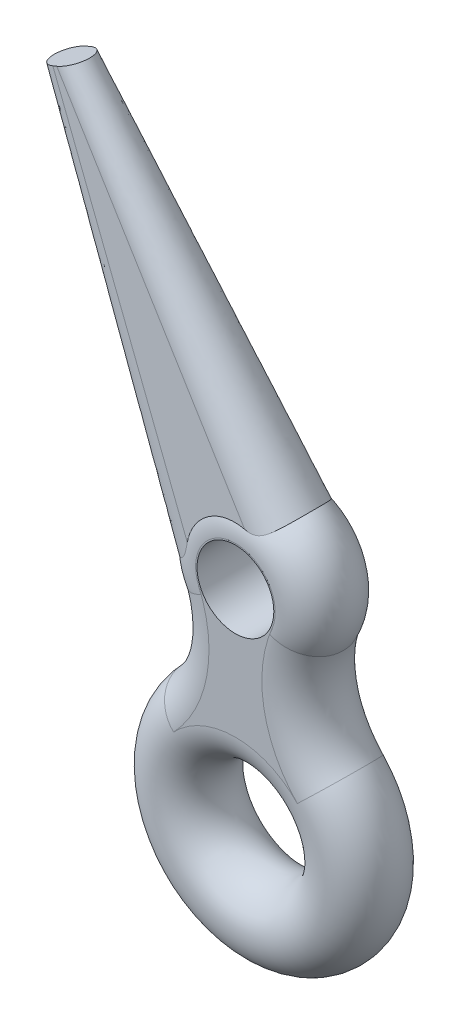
ISO-10303-21;
HEADER;
FILE_DESCRIPTION(('STEP AP214'),'2;1');
FILE_NAME('part.step','',(''),(''),'','','');
FILE_SCHEMA(('AUTOMOTIVE_DESIGN { 1 0 10303 214 1 1 1 1 }'));
ENDSEC;
DATA;
#1=APPLICATION_CONTEXT('core data for automotive mechanical design processes');
#2=APPLICATION_PROTOCOL_DEFINITION('international standard','automotive_design',2000,#1);
#3=PRODUCT_CONTEXT('',#1,'mechanical');
#4=PRODUCT('Part','Part','',(#3));
#5=PRODUCT_RELATED_PRODUCT_CATEGORY('part','',(#4));
#6=PRODUCT_DEFINITION_FORMATION('','',#4);
#7=PRODUCT_DEFINITION_CONTEXT('part definition',#1,'design');
#8=PRODUCT_DEFINITION('design','',#6,#7);
#9=PRODUCT_DEFINITION_SHAPE('','',#8);
#10=(LENGTH_UNIT() NAMED_UNIT(*) SI_UNIT(.MILLI.,.METRE.));
#11=(NAMED_UNIT(*) PLANE_ANGLE_UNIT() SI_UNIT($,.RADIAN.));
#12=(NAMED_UNIT(*) SI_UNIT($,.STERADIAN.) SOLID_ANGLE_UNIT());
#13=UNCERTAINTY_MEASURE_WITH_UNIT(LENGTH_MEASURE(1.E-05),#10,'distance_accuracy_value','');
#14=(GEOMETRIC_REPRESENTATION_CONTEXT(3) GLOBAL_UNCERTAINTY_ASSIGNED_CONTEXT((#13)) GLOBAL_UNIT_ASSIGNED_CONTEXT((#10,
#11,#12)) REPRESENTATION_CONTEXT('',''));
#15=CARTESIAN_POINT('',(0.,0.,0.));
#16=DIRECTION('',(0.,0.,1.));
#17=DIRECTION('',(1.,0.,0.));
#18=AXIS2_PLACEMENT_3D('',#15,#16,#17);
#19=CARTESIAN_POINT('',(-36.3841857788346,34.572057,9.));
#20=DIRECTION('',(0.,0.,-1.));
#21=DIRECTION('',(-1.,0.,0.));
#22=AXIS2_PLACEMENT_3D('',#19,#20,#21);
#23=CYLINDRICAL_SURFACE('',#22,30.19);
#24=DIRECTION('',(0.,0.,-1.));
#25=VECTOR('',#24,1.);
#26=CARTESIAN_POINT('',(-8.58968758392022,46.3577249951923,9.));
#27=LINE('',#26,#25);
#28=CARTESIAN_POINT('',(-8.58968758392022,46.3577249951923,9.));
#29=VERTEX_POINT('',#28);
#30=CARTESIAN_POINT('',(-8.58968758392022,46.3577249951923,8.9983943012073));
#31=VERTEX_POINT('',#30);
#32=EDGE_CURVE('E457',#29,#31,#27,.T.);
#33=ORIENTED_EDGE('',*,*,#32,.T.);
#34=CARTESIAN_POINT('',(-8.60882043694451,46.402745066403,8.9983974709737));
#35=CARTESIAN_POINT('',(-8.60240107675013,46.3876740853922,8.99839534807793));
#36=CARTESIAN_POINT('',(-8.59599399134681,46.3725978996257,8.9983942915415));
#37=CARTESIAN_POINT('',(-8.58320437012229,46.3424351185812,8.99839431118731));
#38=CARTESIAN_POINT('',(-8.57682183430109,46.3273485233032,8.99839538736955));
#39=CARTESIAN_POINT('',(-8.57045157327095,46.3122567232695,8.99839752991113));
#40=B_SPLINE_CURVE_WITH_KNOTS('',3,(#34,#35,#36,#37,#38,#39),.UNSPECIFIED.,.F.,.F.,(4,2,4),(0.,
0.0491434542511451,0.0982869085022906),.UNSPECIFIED.);
#41=CARTESIAN_POINT('',(-8.58949753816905,46.3572767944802,8.99839430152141));
#42=VERTEX_POINT('',#41);
#43=EDGE_CURVE('E266',#31,#42,#40,.T.);
#44=ORIENTED_EDGE('',*,*,#43,.T.);
#45=DIRECTION('',(0.,0.,-1.));
#46=VECTOR('',#45,1.);
#47=CARTESIAN_POINT('',(-8.58949753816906,46.3572767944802,9.));
#48=LINE('',#47,#46);
#49=CARTESIAN_POINT('',(-8.58949753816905,46.3572767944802,8.99999874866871));
#50=VERTEX_POINT('',#49);
#51=EDGE_CURVE('E363',#42,#50,#48,.F.);
#52=ORIENTED_EDGE('',*,*,#51,.T.);
#53=CARTESIAN_POINT('',(-36.3841857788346,34.572057,9.));
#54=DIRECTION('',(0.,0.,-1.));
#55=DIRECTION('',(-1.,0.,0.));
#56=AXIS2_PLACEMENT_3D('',#53,#54,#55);
#57=CIRCLE('',#56,30.19);
#58=EDGE_CURVE('E462',#29,#50,#57,.T.);
#59=ORIENTED_EDGE('',*,*,#58,.F.);
#60=EDGE_LOOP('',(#33,#44,#52,#59));
#61=FACE_BOUND('',#60,.T.);
#62=ADVANCED_FACE('F35',(#61),#23,.F.);
#63=CARTESIAN_POINT('',(36.3841857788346,34.572057,9.));
#64=DIRECTION('',(0.,0.,-1.));
#65=DIRECTION('',(-1.,0.,0.));
#66=AXIS2_PLACEMENT_3D('',#63,#64,#65);
#67=CYLINDRICAL_SURFACE('',#66,30.19);
#68=DIRECTION('',(0.,0.,-1.));
#69=VECTOR('',#68,1.);
#70=CARTESIAN_POINT('',(8.58968758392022,46.3577249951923,9.));
#71=LINE('',#70,#69);
#72=CARTESIAN_POINT('',(8.58968758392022,46.3577249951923,-8.9983943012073));
#73=VERTEX_POINT('',#72);
#74=CARTESIAN_POINT('',(8.58968758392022,46.3577249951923,-9.));
#75=VERTEX_POINT('',#74);
#76=EDGE_CURVE('E460',#73,#75,#71,.T.);
#77=ORIENTED_EDGE('',*,*,#76,.F.);
#78=CARTESIAN_POINT('',(8.6088204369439,46.4027450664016,-8.9983974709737));
#79=CARTESIAN_POINT('',(8.60240107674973,46.3876740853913,-8.99839534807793));
#80=CARTESIAN_POINT('',(8.5959939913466,46.3725978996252,-8.9983942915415));
#81=CARTESIAN_POINT('',(8.58320437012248,46.3424351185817,-8.99839431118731));
#82=CARTESIAN_POINT('',(8.57682183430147,46.3273485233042,-8.99839538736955));
#83=CARTESIAN_POINT('',(8.57045157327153,46.3122567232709,-8.99839752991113));
#84=B_SPLINE_CURVE_WITH_KNOTS('',3,(#78,#79,#80,#81,#82,#83),.UNSPECIFIED.,.F.,.F.,(4,2,4),(0.,
0.0491434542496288,0.0982869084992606),.UNSPECIFIED.);
#85=CARTESIAN_POINT('',(8.58949753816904,46.3572767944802,-8.99839430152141));
#86=VERTEX_POINT('',#85);
#87=EDGE_CURVE('E251',#73,#86,#84,.T.);
#88=ORIENTED_EDGE('',*,*,#87,.T.);
#89=DIRECTION('',(0.,0.,-1.));
#90=VECTOR('',#89,1.);
#91=CARTESIAN_POINT('',(8.58949753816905,46.3572767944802,9.));
#92=LINE('',#91,#90);
#93=CARTESIAN_POINT('',(8.58949753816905,46.3572767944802,-9.));
#94=VERTEX_POINT('',#93);
#95=EDGE_CURVE('E473',#86,#94,#92,.T.);
#96=ORIENTED_EDGE('',*,*,#95,.T.);
#97=CARTESIAN_POINT('',(36.3841857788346,34.572057,-9.));
#98=DIRECTION('',(0.,0.,-1.));
#99=DIRECTION('',(1.,0.,0.));
#100=AXIS2_PLACEMENT_3D('',#97,#98,#99);
#101=CIRCLE('',#100,30.19);
#102=EDGE_CURVE('E477',#94,#75,#101,.T.);
#103=ORIENTED_EDGE('',*,*,#102,.T.);
#104=EDGE_LOOP('',(#77,#88,#96,#103));
#105=FACE_BOUND('',#104,.T.);
#106=ADVANCED_FACE('F330',(#105),#67,.F.);
#107=CARTESIAN_POINT('',(0.,50.,9.));
#108=DIRECTION('',(0.,0.,-1.));
#109=DIRECTION('',(-1.,0.,0.));
#110=AXIS2_PLACEMENT_3D('',#107,#108,#109);
#111=CYLINDRICAL_SURFACE('',#110,9.33);
#112=CARTESIAN_POINT('',(-8.58968758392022,46.3577249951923,-8.9983943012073));
#113=VERTEX_POINT('',#112);
#114=CARTESIAN_POINT('',(-8.58968758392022,46.3577249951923,-9.));
#115=VERTEX_POINT('',#114);
#116=EDGE_CURVE('E454',#113,#115,#27,.T.);
#117=ORIENTED_EDGE('',*,*,#116,.F.);
#118=CARTESIAN_POINT('',(0.,50.,-8.9983943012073));
#119=DIRECTION('',(0.,0.,1.));
#120=DIRECTION('',(1.,0.,0.));
#121=AXIS2_PLACEMENT_3D('',#118,#119,#120);
#122=CIRCLE('',#121,9.33);
#123=EDGE_CURVE('E213',#113,#73,#122,.F.);
#124=ORIENTED_EDGE('',*,*,#123,.T.);
#125=ORIENTED_EDGE('',*,*,#76,.T.);
#126=CARTESIAN_POINT('',(0.,50.,-9.));
#127=DIRECTION('',(0.,0.,1.));
#128=DIRECTION('',(1.,0.,0.));
#129=AXIS2_PLACEMENT_3D('',#126,#127,#128);
#130=CIRCLE('',#129,9.33);
#131=EDGE_CURVE('E456',#75,#115,#130,.T.);
#132=ORIENTED_EDGE('',*,*,#131,.T.);
#133=EDGE_LOOP('',(#117,#124,#125,#132));
#134=FACE_BOUND('',#133,.T.);
#135=ADVANCED_FACE('F335',(#134),#111,.T.);
#136=CARTESIAN_POINT('',(-8.59386680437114,46.3554238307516,0.));
#137=DIRECTION('',(0.390431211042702,-0.920632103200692,0.));
#138=DIRECTION('',(0.920632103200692,0.390431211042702,0.));
#139=AXIS2_PLACEMENT_3D('',#136,#137,#138);
#140=PLANE('',#139);
#141=ORIENTED_EDGE('',*,*,#51,.F.);
#142=CARTESIAN_POINT('',(-8.74600498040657,46.2909034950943,0.));
#143=DIRECTION('',(0.390431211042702,-0.920632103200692,0.));
#144=DIRECTION('',(0.920632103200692,0.390431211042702,0.));
#145=AXIS2_PLACEMENT_3D('',#142,#143,#144);
#146=CIRCLE('',#145,9.00000000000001);
#147=CARTESIAN_POINT('',(-8.66993589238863,46.3231636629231,8.99962070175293));
#148=VERTEX_POINT('',#147);
#149=EDGE_CURVE('E207',#42,#148,#146,.T.);
#150=ORIENTED_EDGE('',*,*,#149,.T.);
#151=CARTESIAN_POINT('',(-8.59386680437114,46.3554238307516,0.));
#152=DIRECTION('',(0.390431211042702,-0.920632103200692,0.));
#153=DIRECTION('',(0.920632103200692,0.390431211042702,0.));
#154=AXIS2_PLACEMENT_3D('',#151,#152,#153);
#155=CIRCLE('',#154,9.);
#156=EDGE_CURVE('E397',#50,#148,#155,.T.);
#157=ORIENTED_EDGE('',*,*,#156,.F.);
#158=EDGE_LOOP('',(#141,#150,#157));
#159=FACE_BOUND('',#158,.T.);
#160=ADVANCED_FACE('F348',(#159),#140,.F.);
#161=CARTESIAN_POINT('',(8.59386680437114,46.3554238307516,0.));
#162=DIRECTION('',(-0.390431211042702,-0.920632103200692,0.));
#163=DIRECTION('',(-0.920632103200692,0.390431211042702,0.));
#164=AXIS2_PLACEMENT_3D('',#161,#162,#163);
#165=PLANE('',#164);
#166=CARTESIAN_POINT('',(8.59386680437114,46.3554238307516,0.));
#167=DIRECTION('',(0.390431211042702,0.920632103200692,0.));
#168=DIRECTION('',(-0.920632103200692,0.390431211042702,0.));
#169=AXIS2_PLACEMENT_3D('',#166,#167,#168);
#170=CIRCLE('',#169,9.);
#171=CARTESIAN_POINT('',(8.58949753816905,46.3572767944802,8.99999874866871));
#172=VERTEX_POINT('',#171);
#173=CARTESIAN_POINT('',(8.6699358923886,46.3231636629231,8.99962070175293));
#174=VERTEX_POINT('',#173);
#175=EDGE_CURVE('E411',#172,#174,#170,.T.);
#176=ORIENTED_EDGE('',*,*,#175,.T.);
#177=CARTESIAN_POINT('',(8.74600498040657,46.2909034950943,0.));
#178=DIRECTION('',(-0.390431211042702,-0.920632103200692,0.));
#179=DIRECTION('',(0.920632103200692,-0.390431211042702,0.));
#180=AXIS2_PLACEMENT_3D('',#177,#178,#179);
#181=CIRCLE('',#180,9.00000000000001);
#182=CARTESIAN_POINT('',(8.58949753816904,46.3572767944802,8.99839430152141));
#183=VERTEX_POINT('',#182);
#184=EDGE_CURVE('E376',#174,#183,#181,.T.);
#185=ORIENTED_EDGE('',*,*,#184,.T.);
#186=EDGE_CURVE('E478',#172,#183,#92,.T.);
#187=ORIENTED_EDGE('',*,*,#186,.F.);
#188=EDGE_LOOP('',(#176,#185,#187));
#189=FACE_BOUND('',#188,.T.);
#190=ADVANCED_FACE('F340',(#189),#165,.F.);
#191=CARTESIAN_POINT('',(-8.58949753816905,46.3572767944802,-8.99999874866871));
#192=VERTEX_POINT('',#191);
#193=CARTESIAN_POINT('',(-8.58949753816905,46.3572767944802,-8.99839430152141));
#194=VERTEX_POINT('',#193);
#195=EDGE_CURVE('E355',#192,#194,#48,.F.);
#196=ORIENTED_EDGE('',*,*,#195,.T.);
#197=CARTESIAN_POINT('',(-8.57045157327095,46.3122567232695,-8.99839752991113));
#198=CARTESIAN_POINT('',(-8.57682183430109,46.3273485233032,-8.99839538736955));
#199=CARTESIAN_POINT('',(-8.58320437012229,46.3424351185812,-8.99839431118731));
#200=CARTESIAN_POINT('',(-8.59599399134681,46.3725978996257,-8.9983942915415));
#201=CARTESIAN_POINT('',(-8.60240107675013,46.3876740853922,-8.99839534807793));
#202=CARTESIAN_POINT('',(-8.60882043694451,46.402745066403,-8.9983974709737));
#203=B_SPLINE_CURVE_WITH_KNOTS('',3,(#197,#198,#199,#200,#201,#202),.UNSPECIFIED.,.F.,.F.,(4,2,
4),(0.,0.0491434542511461,0.0982869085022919),.UNSPECIFIED.);
#204=EDGE_CURVE('E205',#194,#113,#203,.T.);
#205=ORIENTED_EDGE('',*,*,#204,.T.);
#206=ORIENTED_EDGE('',*,*,#116,.T.);
#207=CARTESIAN_POINT('',(-36.3841857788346,34.572057,-9.));
#208=DIRECTION('',(0.,0.,-1.));
#209=DIRECTION('',(-1.,0.,0.));
#210=AXIS2_PLACEMENT_3D('',#207,#208,#209);
#211=CIRCLE('',#210,30.19);
#212=EDGE_CURVE('E359',#115,#192,#211,.T.);
#213=ORIENTED_EDGE('',*,*,#212,.T.);
#214=EDGE_LOOP('',(#196,#205,#206,#213));
#215=FACE_BOUND('',#214,.T.);
#216=ADVANCED_FACE('F215',(#215),#23,.F.);
#217=ORIENTED_EDGE('',*,*,#186,.T.);
#218=CARTESIAN_POINT('',(8.57045157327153,46.3122567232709,8.99839752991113));
#219=CARTESIAN_POINT('',(8.57682183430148,46.3273485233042,8.99839538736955));
#220=CARTESIAN_POINT('',(8.58320437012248,46.3424351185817,8.99839431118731));
#221=CARTESIAN_POINT('',(8.59599399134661,46.3725978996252,8.9983942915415));
#222=CARTESIAN_POINT('',(8.60240107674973,46.3876740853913,8.99839534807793));
#223=CARTESIAN_POINT('',(8.60882043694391,46.4027450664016,8.9983974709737));
#224=B_SPLINE_CURVE_WITH_KNOTS('',3,(#218,#219,#220,#221,#222,#223),.UNSPECIFIED.,.F.,.F.,(4,2,
4),(0.,0.0491434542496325,0.098286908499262),.UNSPECIFIED.);
#225=CARTESIAN_POINT('',(8.58968758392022,46.3577249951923,8.9983943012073));
#226=VERTEX_POINT('',#225);
#227=EDGE_CURVE('E273',#183,#226,#224,.T.);
#228=ORIENTED_EDGE('',*,*,#227,.T.);
#229=CARTESIAN_POINT('',(8.58968758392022,46.3577249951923,9.));
#230=VERTEX_POINT('',#229);
#231=EDGE_CURVE('E468',#230,#226,#71,.T.);
#232=ORIENTED_EDGE('',*,*,#231,.F.);
#233=CARTESIAN_POINT('',(36.3841857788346,34.572057,9.));
#234=DIRECTION('',(0.,0.,-1.));
#235=DIRECTION('',(1.,0.,0.));
#236=AXIS2_PLACEMENT_3D('',#233,#234,#235);
#237=CIRCLE('',#236,30.19);
#238=EDGE_CURVE('E488',#172,#230,#237,.T.);
#239=ORIENTED_EDGE('',*,*,#238,.F.);
#240=EDGE_LOOP('',(#217,#228,#232,#239));
#241=FACE_BOUND('',#240,.T.);
#242=ADVANCED_FACE('F337',(#241),#67,.F.);
#243=ORIENTED_EDGE('',*,*,#231,.T.);
#244=CARTESIAN_POINT('',(0.,50.,8.9983943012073));
#245=DIRECTION('',(0.,0.,-1.));
#246=DIRECTION('',(-1.,0.,0.));
#247=AXIS2_PLACEMENT_3D('',#244,#245,#246);
#248=CIRCLE('',#247,9.33);
#249=EDGE_CURVE('E384',#226,#31,#248,.F.);
#250=ORIENTED_EDGE('',*,*,#249,.T.);
#251=ORIENTED_EDGE('',*,*,#32,.F.);
#252=CARTESIAN_POINT('',(0.,50.,9.));
#253=DIRECTION('',(0.,0.,1.));
#254=DIRECTION('',(1.,0.,0.));
#255=AXIS2_PLACEMENT_3D('',#252,#253,#254);
#256=CIRCLE('',#255,9.33);
#257=EDGE_CURVE('E499',#230,#29,#256,.T.);
#258=ORIENTED_EDGE('',*,*,#257,.F.);
#259=EDGE_LOOP('',(#243,#250,#251,#258));
#260=FACE_BOUND('',#259,.T.);
#261=ADVANCED_FACE('F346',(#260),#111,.T.);
#262=CARTESIAN_POINT('',(18.1920928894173,17.2860285,9.));
#263=DIRECTION('',(0.,0.,1.));
#264=DIRECTION('',(1.,0.,0.));
#265=AXIS2_PLACEMENT_3D('',#262,#263,#264);
#266=PLANE('',#265);
#267=CARTESIAN_POINT('',(0.,50.,9.));
#268=DIRECTION('',(0.,0.,1.));
#269=DIRECTION('',(1.,0.,0.));
#270=AXIS2_PLACEMENT_3D('',#267,#268,#269);
#271=CIRCLE('',#270,9.);
#272=CARTESIAN_POINT('',(9.,50.,9.));
#273=VERTEX_POINT('',#272);
#274=EDGE_CURVE('E199',#273,#273,#271,.T.);
#275=ORIENTED_EDGE('',*,*,#274,.F.);
#276=EDGE_LOOP('',(#275));
#277=FACE_BOUND('',#276,.T.);
#278=CARTESIAN_POINT('',(14.4985785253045,13.7764710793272,8.99999999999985));
#279=VERTEX_POINT('',#278);
#280=EDGE_CURVE('E497',#279,#172,#237,.T.);
#281=ORIENTED_EDGE('',*,*,#280,.T.);
#282=ORIENTED_EDGE('',*,*,#238,.T.);
#283=ORIENTED_EDGE('',*,*,#257,.T.);
#284=ORIENTED_EDGE('',*,*,#58,.T.);
#285=CARTESIAN_POINT('',(-14.4985785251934,13.7764710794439,8.99999999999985));
#286=VERTEX_POINT('',#285);
#287=EDGE_CURVE('E404',#50,#286,#57,.T.);
#288=ORIENTED_EDGE('',*,*,#287,.T.);
#289=CARTESIAN_POINT('',(0.,0.,9.));
#290=DIRECTION('',(0.,0.,-1.));
#291=DIRECTION('',(1.,0.,0.));
#292=AXIS2_PLACEMENT_3D('',#289,#290,#291);
#293=CIRCLE('',#292,20.);
#294=EDGE_CURVE('E458',#286,#279,#293,.T.);
#295=ORIENTED_EDGE('',*,*,#294,.T.);
#296=EDGE_LOOP('',(#281,#282,#283,#284,#288,#295));
#297=FACE_BOUND('',#296,.T.);
#298=ADVANCED_FACE('F226',(#277,#297),#266,.T.);
#299=CARTESIAN_POINT('',(18.1920928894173,17.2860285,-9.));
#300=DIRECTION('',(0.,0.,1.));
#301=DIRECTION('',(1.,0.,0.));
#302=AXIS2_PLACEMENT_3D('',#299,#300,#301);
#303=PLANE('',#302);
#304=CARTESIAN_POINT('',(0.,50.,-9.));
#305=DIRECTION('',(0.,0.,-1.));
#306=DIRECTION('',(-1.,0.,0.));
#307=AXIS2_PLACEMENT_3D('',#304,#305,#306);
#308=CIRCLE('',#307,9.);
#309=CARTESIAN_POINT('',(-9.,50.,-9.));
#310=VERTEX_POINT('',#309);
#311=EDGE_CURVE('E513',#310,#310,#308,.T.);
#312=ORIENTED_EDGE('',*,*,#311,.F.);
#313=EDGE_LOOP('',(#312));
#314=FACE_BOUND('',#313,.T.);
#315=CARTESIAN_POINT('',(0.,0.,-9.));
#316=DIRECTION('',(0.,0.,-1.));
#317=DIRECTION('',(1.,0.,0.));
#318=AXIS2_PLACEMENT_3D('',#315,#316,#317);
#319=CIRCLE('',#318,20.);
#320=CARTESIAN_POINT('',(-14.4985785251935,13.776471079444,-8.99999999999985));
#321=VERTEX_POINT('',#320);
#322=CARTESIAN_POINT('',(14.4985785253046,13.7764710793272,-8.99999999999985));
#323=VERTEX_POINT('',#322);
#324=EDGE_CURVE('E466',#321,#323,#319,.T.);
#325=ORIENTED_EDGE('',*,*,#324,.F.);
#326=EDGE_CURVE('E487',#192,#321,#211,.T.);
#327=ORIENTED_EDGE('',*,*,#326,.F.);
#328=ORIENTED_EDGE('',*,*,#212,.F.);
#329=ORIENTED_EDGE('',*,*,#131,.F.);
#330=ORIENTED_EDGE('',*,*,#102,.F.);
#331=EDGE_CURVE('E483',#323,#94,#101,.T.);
#332=ORIENTED_EDGE('',*,*,#331,.F.);
#333=EDGE_LOOP('',(#325,#327,#328,#329,#330,#332));
#334=FACE_BOUND('',#333,.T.);
#335=ADVANCED_FACE('F447',(#314,#334),#303,.F.);
#336=CARTESIAN_POINT('',(0.,0.,0.));
#337=DIRECTION('',(0.,0.,-1.));
#338=DIRECTION('',(-1.,0.,0.));
#339=AXIS2_PLACEMENT_3D('',#336,#337,#338);
#340=TOROIDAL_SURFACE('',#339,20.,9.);
#341=ORIENTED_EDGE('',*,*,#294,.F.);
#342=CARTESIAN_POINT('',(-14.5,13.7749773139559,-9.));
#343=CARTESIAN_POINT('',(-14.4540833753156,13.8233106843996,-8.99999998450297));
#344=CARTESIAN_POINT('',(-14.4081259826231,13.87160528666,-9.00000001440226));
#345=CARTESIAN_POINT('',(-14.3363123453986,13.9469436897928,-8.99999993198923));
#346=CARTESIAN_POINT('',(-14.3104839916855,13.9740140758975,-8.99999987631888));
#347=CARTESIAN_POINT('',(-14.1812779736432,14.1093050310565,-8.99999935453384));
#348=CARTESIAN_POINT('',(-14.0777080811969,14.2173421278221,-8.99999815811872));
#349=CARTESIAN_POINT('',(-13.8567946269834,14.4469131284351,-8.99998493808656));
#350=CARTESIAN_POINT('',(-13.7393951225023,14.5683932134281,-8.9999715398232));
#351=CARTESIAN_POINT('',(-13.5388678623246,14.7750082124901,-8.9999144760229));
#352=CARTESIAN_POINT('',(-13.4558701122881,14.860269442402,-8.99988093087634));
#353=CARTESIAN_POINT('',(-13.0402374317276,15.2859602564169,-8.9996417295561));
#354=CARTESIAN_POINT('',(-12.7056876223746,15.6245263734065,-8.99922164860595));
#355=CARTESIAN_POINT('',(-12.1545032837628,16.1757999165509,-8.99711032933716));
#356=CARTESIAN_POINT('',(-11.9390416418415,16.3896843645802,-8.99593452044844));
#357=CARTESIAN_POINT('',(-11.5066702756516,16.8157328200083,-8.99237941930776));
#358=CARTESIAN_POINT('',(-11.2897614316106,17.0278977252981,-8.99000080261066));
#359=CARTESIAN_POINT('',(-10.854428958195,17.4506392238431,-8.98345157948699));
#360=CARTESIAN_POINT('',(-10.6360053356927,17.6612158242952,-8.9792809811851));
#361=CARTESIAN_POINT('',(-10.1973481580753,18.0811359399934,-8.96844496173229));
#362=CARTESIAN_POINT('',(-9.97711222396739,18.290476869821,-8.96177546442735));
#363=CARTESIAN_POINT('',(-9.53526146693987,18.7075862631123,-8.94515264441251));
#364=CARTESIAN_POINT('',(-9.31364659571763,18.9153546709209,-8.93519920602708));
#365=CARTESIAN_POINT('',(-8.84434733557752,19.3524024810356,-8.90979126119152));
#366=CARTESIAN_POINT('',(-8.59651403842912,19.581494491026,-8.893846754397));
#367=CARTESIAN_POINT('',(-8.09948108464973,20.0376685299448,-8.85550323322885));
#368=CARTESIAN_POINT('',(-7.8502814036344,20.2647505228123,-8.83310410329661));
#369=CARTESIAN_POINT('',(-7.35068090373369,20.7168992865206,-8.78040872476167));
#370=CARTESIAN_POINT('',(-7.10027961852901,20.9419651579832,-8.7501091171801));
#371=CARTESIAN_POINT('',(-6.5987247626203,21.3898312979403,-8.68007356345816));
#372=CARTESIAN_POINT('',(-6.34757114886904,21.6126314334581,-8.64033706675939));
#373=CARTESIAN_POINT('',(-5.84592050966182,22.0548876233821,-8.54994649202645));
#374=CARTESIAN_POINT('',(-5.5954244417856,22.274352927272,-8.49933286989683));
#375=CARTESIAN_POINT('',(-5.09481174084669,22.710383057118,-8.38537707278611));
#376=CARTESIAN_POINT('',(-4.84469507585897,22.9269481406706,-8.32203603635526));
#377=CARTESIAN_POINT('',(-4.34585790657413,23.3564859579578,-8.18085988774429));
#378=CARTESIAN_POINT('',(-4.09713630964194,23.5694618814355,-8.1030384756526));
#379=CARTESIAN_POINT('',(-3.60194623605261,23.9912924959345,-7.93097214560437));
#380=CARTESIAN_POINT('',(-3.35547724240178,24.2001481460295,-7.83673110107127));
#381=CARTESIAN_POINT('',(-2.90163951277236,24.58287318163,-7.64486425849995));
#382=CARTESIAN_POINT('',(-2.69379594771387,24.7574143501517,-7.54972269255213));
#383=CARTESIAN_POINT('',(-2.28179173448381,25.1020699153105,-7.34476922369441));
#384=CARTESIAN_POINT('',(-2.07763101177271,25.272184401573,-7.23495761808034));
#385=CARTESIAN_POINT('',(-1.47181567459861,25.7751494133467,-6.88116960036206));
#386=CARTESIAN_POINT('',(-1.07714674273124,26.1003530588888,-6.61296929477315));
#387=CARTESIAN_POINT('',(-0.507989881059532,26.5665394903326,-6.15410528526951));
#388=CARTESIAN_POINT('',(-0.320972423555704,26.7192253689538,-5.99050779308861));
#389=CARTESIAN_POINT('',(0.0422918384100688,27.0149820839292,-5.64356694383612));
#390=CARTESIAN_POINT('',(0.218537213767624,27.1580516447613,-5.46022097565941));
#391=CARTESIAN_POINT('',(0.557082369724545,27.4321942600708,-5.07372024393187));
#392=CARTESIAN_POINT('',(0.719412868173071,27.5632937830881,-4.87061134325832));
#393=CARTESIAN_POINT('',(1.02743918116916,27.8115308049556,-4.44426782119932));
#394=CARTESIAN_POINT('',(1.17314436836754,27.9286761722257,-4.22104466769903));
#395=CARTESIAN_POINT('',(1.39912384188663,28.1100396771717,-3.83323769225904));
#396=CARTESIAN_POINT('',(1.48497950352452,28.1788527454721,-3.67402193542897));
#397=CARTESIAN_POINT('',(1.64680064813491,28.3084163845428,-3.34750893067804));
#398=CARTESIAN_POINT('',(1.72276885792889,28.3691691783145,-3.18021392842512));
#399=CARTESIAN_POINT('',(1.86377466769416,28.4818342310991,-2.83825211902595));
#400=CARTESIAN_POINT('',(1.92881557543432,28.5337491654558,-2.66358756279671));
#401=CARTESIAN_POINT('',(2.04701536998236,28.6280281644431,-2.30775240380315));
#402=CARTESIAN_POINT('',(2.10017386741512,28.670391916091,-2.12658158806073));
#403=CARTESIAN_POINT('',(2.19401171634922,28.7451346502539,-1.75777300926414));
#404=CARTESIAN_POINT('',(2.23461235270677,28.7774506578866,-1.57010234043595));
#405=CARTESIAN_POINT('',(2.30215539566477,28.8311925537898,-1.19077183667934));
#406=CARTESIAN_POINT('',(2.32909776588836,28.852618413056,-0.999111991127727));
#407=CARTESIAN_POINT('',(2.3688046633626,28.8841900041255,-0.613459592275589));
#408=CARTESIAN_POINT('',(2.38157332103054,28.8943390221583,-0.419467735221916));
#409=CARTESIAN_POINT('',(2.3926935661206,28.9031780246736,-0.0308178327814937));
#410=CARTESIAN_POINT('',(2.39104629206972,28.9018689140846,0.1638401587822));
#411=CARTESIAN_POINT('',(2.37420856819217,28.8884847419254,0.533750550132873));
#412=CARTESIAN_POINT('',(2.36031032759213,28.8774369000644,0.709101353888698));
#413=CARTESIAN_POINT('',(2.32094077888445,28.8461313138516,1.05772839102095));
#414=CARTESIAN_POINT('',(2.2954655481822,28.8258704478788,1.23100390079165));
#415=CARTESIAN_POINT('',(2.23335032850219,28.7764456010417,1.5741623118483));
#416=CARTESIAN_POINT('',(2.19671524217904,28.7472855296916,1.74404666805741));
#417=CARTESIAN_POINT('',(2.11280532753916,28.680455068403,2.07951390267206));
#418=CARTESIAN_POINT('',(2.06552650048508,28.6427814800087,2.24509513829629));
#419=CARTESIAN_POINT('',(1.96028161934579,28.5588544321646,2.57319609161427));
#420=CARTESIAN_POINT('',(1.9021801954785,28.5124922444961,2.73564453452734));
#421=CARTESIAN_POINT('',(1.7764864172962,28.4121031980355,3.05440782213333));
#422=CARTESIAN_POINT('',(1.7088904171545,28.3580733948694,3.21072028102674));
#423=CARTESIAN_POINT('',(1.49303753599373,28.1853606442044,3.66951893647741));
#424=CARTESIAN_POINT('',(1.33166672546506,28.0560153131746,3.9620161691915));
#425=CARTESIAN_POINT('',(1.02922821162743,27.8129399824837,4.44032135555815));
#426=CARTESIAN_POINT('',(0.89481336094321,27.7047239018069,4.63332296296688));
#427=CARTESIAN_POINT('',(0.613474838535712,27.477731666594,5.00342069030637));
#428=CARTESIAN_POINT('',(0.466546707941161,27.3589517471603,5.18051109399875));
#429=CARTESIAN_POINT('',(0.00979440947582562,26.9888118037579,5.688348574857));
#430=CARTESIAN_POINT('',(-0.315760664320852,26.7238415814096,5.99529918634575));
#431=CARTESIAN_POINT('',(-0.906944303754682,26.2398579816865,6.4781890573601));
#432=CARTESIAN_POINT('',(-1.16659130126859,26.0264339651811,6.66755404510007));
#433=CARTESIAN_POINT('',(-1.69673844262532,25.5885939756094,7.01605972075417));
#434=CARTESIAN_POINT('',(-1.96724004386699,25.3641765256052,7.17519633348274));
#435=CARTESIAN_POINT('',(-2.51600300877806,24.9065335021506,7.4663322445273));
#436=CARTESIAN_POINT('',(-2.79427658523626,24.6732938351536,7.59828574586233));
#437=CARTESIAN_POINT('',(-3.35551077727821,24.2002249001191,7.83779182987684));
#438=CARTESIAN_POINT('',(-3.63847071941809,23.9603965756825,7.94534788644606));
#439=CARTESIAN_POINT('',(-4.17073936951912,23.5065125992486,8.12667700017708));
#440=CARTESIAN_POINT('',(-4.41972318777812,23.2930839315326,8.20301147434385));
#441=CARTESIAN_POINT('',(-4.91879362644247,22.862871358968,8.34132396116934));
#442=CARTESIAN_POINT('',(-5.16888038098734,22.6460870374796,8.40330017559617));
#443=CARTESIAN_POINT('',(-5.91985662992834,21.9912274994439,8.57049984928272));
#444=CARTESIAN_POINT('',(-6.42120353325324,21.5488658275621,8.65691067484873));
#445=CARTESIAN_POINT('',(-7.42115115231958,20.6548450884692,8.79303603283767));
#446=CARTESIAN_POINT('',(-7.91974822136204,20.2031762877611,8.84270991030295));
#447=CARTESIAN_POINT('',(-8.66338110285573,19.5197890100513,8.89835250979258));
#448=CARTESIAN_POINT('',(-8.91051718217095,19.2910419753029,8.91375458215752));
#449=CARTESIAN_POINT('',(-9.40322387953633,18.8315912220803,8.93955047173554));
#450=CARTESIAN_POINT('',(-9.64879451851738,18.6008875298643,8.94994435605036));
#451=CARTESIAN_POINT('',(-10.0775200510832,18.1950074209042,8.96480201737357));
#452=CARTESIAN_POINT('',(-10.2610474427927,18.0202524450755,8.97009723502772));
#453=CARTESIAN_POINT('',(-10.6270842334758,17.6696457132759,8.97896930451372));
#454=CARTESIAN_POINT('',(-10.8095936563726,17.4937939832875,8.98254619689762));
#455=CARTESIAN_POINT('',(-11.3552058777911,16.9649041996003,8.99132366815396));
#456=CARTESIAN_POINT('',(-11.7167348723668,16.6102077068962,8.99458131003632));
#457=CARTESIAN_POINT('',(-12.2665187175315,16.0640612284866,8.9976242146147));
#458=CARTESIAN_POINT('',(-12.4563706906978,15.8742173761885,8.99832183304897));
#459=CARTESIAN_POINT('',(-12.8348348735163,15.4932349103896,8.99928597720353));
#460=CARTESIAN_POINT('',(-13.0234468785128,15.3020960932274,8.9995524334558));
#461=CARTESIAN_POINT('',(-13.415302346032,14.9023051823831,8.9998941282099));
#462=CARTESIAN_POINT('',(-13.6184316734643,14.6935412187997,8.99995125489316));
#463=CARTESIAN_POINT('',(-14.0018550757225,14.2965705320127,9.00000139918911));
#464=CARTESIAN_POINT('',(-14.1823028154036,14.1085122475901,9.00000053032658));
#465=CARTESIAN_POINT('',(-14.4081260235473,13.8716052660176,8.9999998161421));
#466=CARTESIAN_POINT('',(-14.4540834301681,13.8233106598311,8.9999996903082));
#467=CARTESIAN_POINT('',(-14.5,13.7749773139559,9.));
#468=B_SPLINE_CURVE_WITH_KNOTS('',3,(#342,#343,#344,#345,#346,#347,#348,#349,#350,#351,#352,
#353,#354,#355,#356,#357,#358,#359,#360,#361,#362,#363,#364,#365,#366,#367,#368,#369,#370,#371,
#372,#373,#374,#375,#376,#377,#378,#379,#380,#381,#382,#383,#384,#385,#386,#387,#388,#389,#390,
#391,#392,#393,#394,#395,#396,#397,#398,#399,#400,#401,#402,#403,#404,#405,#406,#407,#408,#409,
#410,#411,#412,#413,#414,#415,#416,#417,#418,#419,#420,#421,#422,#423,#424,#425,#426,#427,#428,
#429,#430,#431,#432,#433,#434,#435,#436,#437,#438,#439,#440,#441,#442,#443,#444,#445,#446,#447,
#448,#449,#450,#451,#452,#453,#454,#455,#456,#457,#458,#459,#460,#461,#462,#463,#464,#465,#466,
#467),.UNSPECIFIED.,.F.,.F.,(4,2,2,2,2,2,2,2,2,2,2,2,2,2,2,2,2,2,2,2,2,2,2,2,2,2,2,2,2,2,2,2,2,
2,2,2,2,2,2,2,2,2,2,2,2,2,2,2,2,2,2,2,2,2,2,2,2,2,2,2,2,2,4),(0.,0.200000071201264,
0.312246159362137,0.761231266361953,1.2680435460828,1.62500691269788,3.05288468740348,
3.96367005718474,4.87394445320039,5.78421472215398,6.69597631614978,7.60777003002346,
8.62133294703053,9.6349140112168,10.6489267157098,11.6629985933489,12.6733621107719,
13.6836352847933,14.6929574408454,15.702041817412,16.564414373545,17.4267694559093,
19.1527819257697,20.0268927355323,20.9011192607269,21.7733633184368,22.6451131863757,
23.2252009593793,23.8051284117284,24.3848799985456,24.9646505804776,25.547984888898,
26.1313207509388,26.7144865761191,27.2976063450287,27.8257194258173,28.3540115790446,
28.8820719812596,29.41033110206,29.9457053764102,30.4812857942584,31.5519643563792,
32.327697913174,33.1037090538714,34.6571328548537,35.8130668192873,36.9691565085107,
38.1271782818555,39.2850350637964,40.2947987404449,41.3046888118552,43.3255150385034,
45.34857428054,46.3598472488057,47.3711066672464,48.1315221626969,48.8919197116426,
50.41130111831,51.2167560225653,52.0223406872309,52.8961723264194,53.6780521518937,
53.8780522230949),.UNSPECIFIED.);
#469=CARTESIAN_POINT('',(-14.5,13.7749773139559,9.));
#470=VERTEX_POINT('',#469);
#471=EDGE_CURVE('E405',#286,#470,#468,.T.);
#472=ORIENTED_EDGE('',*,*,#471,.T.);
#473=CARTESIAN_POINT('',(-14.5,13.7749773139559,0.));
#474=DIRECTION('',(-0.688748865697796,-0.725,0.));
#475=DIRECTION('',(0.725,-0.688748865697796,0.));
#476=AXIS2_PLACEMENT_3D('',#473,#474,#475);
#477=CIRCLE('',#476,9.);
#478=CARTESIAN_POINT('',(-14.5,13.7749773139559,-9.));
#479=VERTEX_POINT('',#478);
#480=EDGE_CURVE('E409',#470,#479,#477,.T.);
#481=ORIENTED_EDGE('',*,*,#480,.T.);
#482=EDGE_CURVE('E415',#479,#321,#468,.T.);
#483=ORIENTED_EDGE('',*,*,#482,.T.);
#484=ORIENTED_EDGE('',*,*,#324,.T.);
#485=CARTESIAN_POINT('',(14.5,13.7749773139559,-9.));
#486=CARTESIAN_POINT('',(14.4540833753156,13.8233106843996,-8.99999998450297));
#487=CARTESIAN_POINT('',(14.4081259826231,13.87160528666,-9.00000001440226));
#488=CARTESIAN_POINT('',(14.3363123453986,13.9469436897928,-8.99999993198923));
#489=CARTESIAN_POINT('',(14.3104839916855,13.9740140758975,-8.99999987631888));
#490=CARTESIAN_POINT('',(14.1812779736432,14.1093050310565,-8.99999935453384));
#491=CARTESIAN_POINT('',(14.0777080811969,14.2173421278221,-8.99999815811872));
#492=CARTESIAN_POINT('',(13.8567946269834,14.4469131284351,-8.99998493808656));
#493=CARTESIAN_POINT('',(13.7393951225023,14.5683932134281,-8.9999715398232));
#494=CARTESIAN_POINT('',(13.5388678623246,14.7750082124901,-8.9999144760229));
#495=CARTESIAN_POINT('',(13.4558701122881,14.860269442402,-8.99988093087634));
#496=CARTESIAN_POINT('',(13.0402374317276,15.2859602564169,-8.9996417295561));
#497=CARTESIAN_POINT('',(12.7056876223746,15.6245263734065,-8.99922164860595));
#498=CARTESIAN_POINT('',(12.1545032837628,16.1757999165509,-8.99711032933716));
#499=CARTESIAN_POINT('',(11.9390416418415,16.3896843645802,-8.99593452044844));
#500=CARTESIAN_POINT('',(11.5066702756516,16.8157328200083,-8.99237941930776));
#501=CARTESIAN_POINT('',(11.2897614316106,17.0278977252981,-8.99000080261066));
#502=CARTESIAN_POINT('',(10.854428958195,17.4506392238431,-8.98345157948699));
#503=CARTESIAN_POINT('',(10.6360053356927,17.6612158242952,-8.9792809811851));
#504=CARTESIAN_POINT('',(10.1973481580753,18.0811359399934,-8.96844496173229));
#505=CARTESIAN_POINT('',(9.97711222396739,18.290476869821,-8.96177546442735));
#506=CARTESIAN_POINT('',(9.53526146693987,18.7075862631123,-8.94515264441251));
#507=CARTESIAN_POINT('',(9.31364659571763,18.9153546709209,-8.93519920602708));
#508=CARTESIAN_POINT('',(8.84434733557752,19.3524024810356,-8.90979126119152));
#509=CARTESIAN_POINT('',(8.59651403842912,19.581494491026,-8.893846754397));
#510=CARTESIAN_POINT('',(8.09948108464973,20.0376685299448,-8.85550323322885));
#511=CARTESIAN_POINT('',(7.8502814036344,20.2647505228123,-8.83310410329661));
#512=CARTESIAN_POINT('',(7.35068090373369,20.7168992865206,-8.78040872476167));
#513=CARTESIAN_POINT('',(7.10027961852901,20.9419651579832,-8.7501091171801));
#514=CARTESIAN_POINT('',(6.5987247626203,21.3898312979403,-8.68007356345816));
#515=CARTESIAN_POINT('',(6.34757114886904,21.6126314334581,-8.64033706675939));
#516=CARTESIAN_POINT('',(5.84592050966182,22.0548876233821,-8.54994649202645));
#517=CARTESIAN_POINT('',(5.5954244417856,22.274352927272,-8.49933286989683));
#518=CARTESIAN_POINT('',(5.09481174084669,22.710383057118,-8.38537707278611));
#519=CARTESIAN_POINT('',(4.84469507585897,22.9269481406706,-8.32203603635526));
#520=CARTESIAN_POINT('',(4.34585790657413,23.3564859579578,-8.18085988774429));
#521=CARTESIAN_POINT('',(4.09713630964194,23.5694618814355,-8.1030384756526));
#522=CARTESIAN_POINT('',(3.60194623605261,23.9912924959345,-7.93097214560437));
#523=CARTESIAN_POINT('',(3.35547724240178,24.2001481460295,-7.83673110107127));
#524=CARTESIAN_POINT('',(2.90163951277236,24.58287318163,-7.64486425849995));
#525=CARTESIAN_POINT('',(2.69379594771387,24.7574143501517,-7.54972269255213));
#526=CARTESIAN_POINT('',(2.28179173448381,25.1020699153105,-7.34476922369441));
#527=CARTESIAN_POINT('',(2.07763101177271,25.272184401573,-7.23495761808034));
#528=CARTESIAN_POINT('',(1.47181567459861,25.7751494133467,-6.88116960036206));
#529=CARTESIAN_POINT('',(1.07714674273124,26.1003530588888,-6.61296929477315));
#530=CARTESIAN_POINT('',(0.507989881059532,26.5665394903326,-6.15410528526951));
#531=CARTESIAN_POINT('',(0.320972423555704,26.7192253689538,-5.99050779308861));
#532=CARTESIAN_POINT('',(-0.0422918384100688,27.0149820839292,-5.64356694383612));
#533=CARTESIAN_POINT('',(-0.218537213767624,27.1580516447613,-5.46022097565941));
#534=CARTESIAN_POINT('',(-0.557082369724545,27.4321942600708,-5.07372024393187));
#535=CARTESIAN_POINT('',(-0.719412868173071,27.5632937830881,-4.87061134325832));
#536=CARTESIAN_POINT('',(-1.02743918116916,27.8115308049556,-4.44426782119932));
#537=CARTESIAN_POINT('',(-1.17314436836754,27.9286761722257,-4.22104466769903));
#538=CARTESIAN_POINT('',(-1.39912384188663,28.1100396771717,-3.83323769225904));
#539=CARTESIAN_POINT('',(-1.48497950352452,28.1788527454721,-3.67402193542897));
#540=CARTESIAN_POINT('',(-1.64680064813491,28.3084163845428,-3.34750893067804));
#541=CARTESIAN_POINT('',(-1.72276885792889,28.3691691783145,-3.18021392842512));
#542=CARTESIAN_POINT('',(-1.86377466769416,28.4818342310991,-2.83825211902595));
#543=CARTESIAN_POINT('',(-1.92881557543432,28.5337491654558,-2.66358756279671));
#544=CARTESIAN_POINT('',(-2.04701536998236,28.6280281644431,-2.30775240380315));
#545=CARTESIAN_POINT('',(-2.10017386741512,28.670391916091,-2.12658158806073));
#546=CARTESIAN_POINT('',(-2.19401171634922,28.7451346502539,-1.75777300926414));
#547=CARTESIAN_POINT('',(-2.23461235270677,28.7774506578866,-1.57010234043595));
#548=CARTESIAN_POINT('',(-2.30215539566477,28.8311925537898,-1.19077183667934));
#549=CARTESIAN_POINT('',(-2.32909776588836,28.852618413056,-0.999111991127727));
#550=CARTESIAN_POINT('',(-2.3688046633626,28.8841900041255,-0.613459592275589));
#551=CARTESIAN_POINT('',(-2.38157332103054,28.8943390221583,-0.419467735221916));
#552=CARTESIAN_POINT('',(-2.3926935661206,28.9031780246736,-0.0308178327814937));
#553=CARTESIAN_POINT('',(-2.39104629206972,28.9018689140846,0.1638401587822));
#554=CARTESIAN_POINT('',(-2.37420856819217,28.8884847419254,0.533750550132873));
#555=CARTESIAN_POINT('',(-2.36031032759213,28.8774369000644,0.709101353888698));
#556=CARTESIAN_POINT('',(-2.32094077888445,28.8461313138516,1.05772839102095));
#557=CARTESIAN_POINT('',(-2.2954655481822,28.8258704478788,1.23100390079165));
#558=CARTESIAN_POINT('',(-2.23335032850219,28.7764456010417,1.5741623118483));
#559=CARTESIAN_POINT('',(-2.19671524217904,28.7472855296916,1.74404666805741));
#560=CARTESIAN_POINT('',(-2.11280532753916,28.680455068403,2.07951390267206));
#561=CARTESIAN_POINT('',(-2.06552650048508,28.6427814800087,2.24509513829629));
#562=CARTESIAN_POINT('',(-1.96028161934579,28.5588544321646,2.57319609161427));
#563=CARTESIAN_POINT('',(-1.9021801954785,28.5124922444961,2.73564453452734));
#564=CARTESIAN_POINT('',(-1.7764864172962,28.4121031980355,3.05440782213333));
#565=CARTESIAN_POINT('',(-1.7088904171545,28.3580733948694,3.21072028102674));
#566=CARTESIAN_POINT('',(-1.49303753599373,28.1853606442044,3.66951893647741));
#567=CARTESIAN_POINT('',(-1.33166672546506,28.0560153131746,3.9620161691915));
#568=CARTESIAN_POINT('',(-1.02922821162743,27.8129399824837,4.44032135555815));
#569=CARTESIAN_POINT('',(-0.89481336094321,27.7047239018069,4.63332296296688));
#570=CARTESIAN_POINT('',(-0.613474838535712,27.477731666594,5.00342069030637));
#571=CARTESIAN_POINT('',(-0.466546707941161,27.3589517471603,5.18051109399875));
#572=CARTESIAN_POINT('',(-0.00979440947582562,26.9888118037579,5.688348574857));
#573=CARTESIAN_POINT('',(0.315760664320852,26.7238415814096,5.99529918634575));
#574=CARTESIAN_POINT('',(0.906944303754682,26.2398579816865,6.4781890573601));
#575=CARTESIAN_POINT('',(1.16659130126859,26.0264339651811,6.66755404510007));
#576=CARTESIAN_POINT('',(1.69673844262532,25.5885939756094,7.01605972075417));
#577=CARTESIAN_POINT('',(1.96724004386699,25.3641765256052,7.17519633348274));
#578=CARTESIAN_POINT('',(2.51600300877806,24.9065335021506,7.4663322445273));
#579=CARTESIAN_POINT('',(2.79427658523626,24.6732938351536,7.59828574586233));
#580=CARTESIAN_POINT('',(3.35551077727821,24.2002249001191,7.83779182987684));
#581=CARTESIAN_POINT('',(3.63847071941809,23.9603965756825,7.94534788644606));
#582=CARTESIAN_POINT('',(4.17073936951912,23.5065125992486,8.12667700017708));
#583=CARTESIAN_POINT('',(4.41972318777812,23.2930839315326,8.20301147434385));
#584=CARTESIAN_POINT('',(4.91879362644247,22.862871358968,8.34132396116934));
#585=CARTESIAN_POINT('',(5.16888038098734,22.6460870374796,8.40330017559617));
#586=CARTESIAN_POINT('',(5.91985662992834,21.9912274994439,8.57049984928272));
#587=CARTESIAN_POINT('',(6.42120353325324,21.5488658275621,8.65691067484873));
#588=CARTESIAN_POINT('',(7.42115115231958,20.6548450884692,8.79303603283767));
#589=CARTESIAN_POINT('',(7.91974822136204,20.2031762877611,8.84270991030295));
#590=CARTESIAN_POINT('',(8.66338110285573,19.5197890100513,8.89835250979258));
#591=CARTESIAN_POINT('',(8.91051718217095,19.2910419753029,8.91375458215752));
#592=CARTESIAN_POINT('',(9.40322387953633,18.8315912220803,8.93955047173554));
#593=CARTESIAN_POINT('',(9.64879451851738,18.6008875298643,8.94994435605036));
#594=CARTESIAN_POINT('',(10.0775200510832,18.1950074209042,8.96480201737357));
#595=CARTESIAN_POINT('',(10.2610474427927,18.0202524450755,8.97009723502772));
#596=CARTESIAN_POINT('',(10.6270842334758,17.6696457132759,8.97896930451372));
#597=CARTESIAN_POINT('',(10.8095936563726,17.4937939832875,8.98254619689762));
#598=CARTESIAN_POINT('',(11.3552058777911,16.9649041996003,8.99132366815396));
#599=CARTESIAN_POINT('',(11.7167348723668,16.6102077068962,8.99458131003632));
#600=CARTESIAN_POINT('',(12.2665187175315,16.0640612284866,8.9976242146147));
#601=CARTESIAN_POINT('',(12.4563706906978,15.8742173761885,8.99832183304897));
#602=CARTESIAN_POINT('',(12.8348348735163,15.4932349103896,8.99928597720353));
#603=CARTESIAN_POINT('',(13.0234468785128,15.3020960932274,8.9995524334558));
#604=CARTESIAN_POINT('',(13.415302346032,14.9023051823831,8.9998941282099));
#605=CARTESIAN_POINT('',(13.6184316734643,14.6935412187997,8.99995125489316));
#606=CARTESIAN_POINT('',(14.0018550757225,14.2965705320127,9.00000139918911));
#607=CARTESIAN_POINT('',(14.1823028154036,14.1085122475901,9.00000053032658));
#608=CARTESIAN_POINT('',(14.4081260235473,13.8716052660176,8.9999998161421));
#609=CARTESIAN_POINT('',(14.4540834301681,13.8233106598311,8.9999996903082));
#610=CARTESIAN_POINT('',(14.5,13.7749773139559,9.));
#611=B_SPLINE_CURVE_WITH_KNOTS('',3,(#485,#486,#487,#488,#489,#490,#491,#492,#493,#494,#495,
#496,#497,#498,#499,#500,#501,#502,#503,#504,#505,#506,#507,#508,#509,#510,#511,#512,#513,#514,
#515,#516,#517,#518,#519,#520,#521,#522,#523,#524,#525,#526,#527,#528,#529,#530,#531,#532,#533,
#534,#535,#536,#537,#538,#539,#540,#541,#542,#543,#544,#545,#546,#547,#548,#549,#550,#551,#552,
#553,#554,#555,#556,#557,#558,#559,#560,#561,#562,#563,#564,#565,#566,#567,#568,#569,#570,#571,
#572,#573,#574,#575,#576,#577,#578,#579,#580,#581,#582,#583,#584,#585,#586,#587,#588,#589,#590,
#591,#592,#593,#594,#595,#596,#597,#598,#599,#600,#601,#602,#603,#604,#605,#606,#607,#608,#609,
#610),.UNSPECIFIED.,.F.,.F.,(4,2,2,2,2,2,2,2,2,2,2,2,2,2,2,2,2,2,2,2,2,2,2,2,2,2,2,2,2,2,2,2,2,
2,2,2,2,2,2,2,2,2,2,2,2,2,2,2,2,2,2,2,2,2,2,2,2,2,2,2,2,2,4),(0.,0.200000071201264,
0.312246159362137,0.761231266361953,1.2680435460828,1.62500691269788,3.05288468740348,
3.96367005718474,4.87394445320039,5.78421472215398,6.69597631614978,7.60777003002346,
8.62133294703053,9.6349140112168,10.6489267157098,11.6629985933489,12.6733621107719,
13.6836352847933,14.6929574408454,15.702041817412,16.564414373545,17.4267694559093,
19.1527819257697,20.0268927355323,20.9011192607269,21.7733633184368,22.6451131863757,
23.2252009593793,23.8051284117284,24.3848799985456,24.9646505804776,25.547984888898,
26.1313207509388,26.7144865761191,27.2976063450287,27.8257194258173,28.3540115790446,
28.8820719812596,29.41033110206,29.9457053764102,30.4812857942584,31.5519643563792,
32.327697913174,33.1037090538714,34.6571328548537,35.8130668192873,36.9691565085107,
38.1271782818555,39.2850350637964,40.2947987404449,41.3046888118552,43.3255150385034,
45.34857428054,46.3598472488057,47.3711066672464,48.1315221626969,48.8919197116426,
50.41130111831,51.2167560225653,52.0223406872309,52.8961723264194,53.6780521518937,
53.8780522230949),.UNSPECIFIED.);
#612=CARTESIAN_POINT('',(14.5,13.7749773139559,-9.));
#613=VERTEX_POINT('',#612);
#614=EDGE_CURVE('E479',#613,#323,#611,.T.);
#615=ORIENTED_EDGE('',*,*,#614,.F.);
#616=CARTESIAN_POINT('',(14.5,13.7749773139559,0.));
#617=DIRECTION('',(-0.688748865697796,0.725,0.));
#618=DIRECTION('',(-0.725,-0.688748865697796,0.));
#619=AXIS2_PLACEMENT_3D('',#616,#617,#618);
#620=CIRCLE('',#619,9.);
#621=CARTESIAN_POINT('',(14.5,13.7749773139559,9.));
#622=VERTEX_POINT('',#621);
#623=EDGE_CURVE('E470',#622,#613,#620,.T.);
#624=ORIENTED_EDGE('',*,*,#623,.F.);
#625=EDGE_CURVE('E421',#279,#622,#611,.T.);
#626=ORIENTED_EDGE('',*,*,#625,.F.);
#627=EDGE_LOOP('',(#341,#472,#481,#483,#484,#615,#624,#626));
#628=FACE_BOUND('',#627,.T.);
#629=ADVANCED_FACE('F37',(#628),#340,.T.);
#630=CARTESIAN_POINT('',(-8.66993589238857,46.3231636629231,-8.99962070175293));
#631=VERTEX_POINT('',#630);
#632=EDGE_CURVE('E406',#631,#192,#155,.T.);
#633=ORIENTED_EDGE('',*,*,#632,.F.);
#634=EDGE_CURVE('E203',#631,#194,#146,.T.);
#635=ORIENTED_EDGE('',*,*,#634,.T.);
#636=ORIENTED_EDGE('',*,*,#195,.F.);
#637=EDGE_LOOP('',(#633,#635,#636));
#638=FACE_BOUND('',#637,.T.);
#639=ADVANCED_FACE('F408',(#638),#140,.F.);
#640=CARTESIAN_POINT('',(36.38775,34.5683055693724,0.));
#641=DIRECTION('',(0.,0.,1.));
#642=DIRECTION('',(1.,0.,0.));
#643=AXIS2_PLACEMENT_3D('',#640,#641,#642);
#644=TOROIDAL_SURFACE('',#643,30.19,9.);
#645=CARTESIAN_POINT('',(8.02831100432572,44.9210018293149,-9.));
#646=CARTESIAN_POINT('',(8.04062473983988,44.9149462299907,-9.00000003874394));
#647=CARTESIAN_POINT('',(8.05293972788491,44.90889234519,-8.99996901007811));
#648=CARTESIAN_POINT('',(8.29374387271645,44.7905615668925,-8.99875500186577));
#649=CARTESIAN_POINT('',(8.5226106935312,44.678894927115,-8.98691206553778));
#650=CARTESIAN_POINT('',(8.9793222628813,44.4575210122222,-8.94188969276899));
#651=CARTESIAN_POINT('',(9.20716617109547,44.3478151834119,-8.90869512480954));
#652=CARTESIAN_POINT('',(9.66062643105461,44.1308067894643,-8.82106122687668));
#653=CARTESIAN_POINT('',(9.88623589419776,44.0235108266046,-8.76656964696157));
#654=CARTESIAN_POINT('',(10.332971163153,43.8122585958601,-8.63670965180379));
#655=CARTESIAN_POINT('',(10.5540968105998,43.7083024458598,-8.56134050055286));
#656=CARTESIAN_POINT('',(10.9899338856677,43.5044882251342,-8.39035385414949));
#657=CARTESIAN_POINT('',(11.2046532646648,43.4046250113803,-8.29476276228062));
#658=CARTESIAN_POINT('',(11.6263859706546,43.209443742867,-8.08392966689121));
#659=CARTESIAN_POINT('',(11.8333989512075,43.1141258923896,-7.96868678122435));
#660=CARTESIAN_POINT('',(12.2380194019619,42.9286663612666,-7.71944271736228));
#661=CARTESIAN_POINT('',(12.4356333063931,42.8385211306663,-7.58545462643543));
#662=CARTESIAN_POINT('',(12.8201239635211,42.6638620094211,-7.29959920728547));
#663=CARTESIAN_POINT('',(13.007000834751,42.5793480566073,-7.14773207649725));
#664=CARTESIAN_POINT('',(13.3680878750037,42.4166742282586,-6.82764997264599));
#665=CARTESIAN_POINT('',(13.542333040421,42.3384967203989,-6.65948343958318));
#666=CARTESIAN_POINT('',(13.8774361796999,42.1886700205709,-6.30761940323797));
#667=CARTESIAN_POINT('',(14.0382941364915,42.1170208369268,-6.12392188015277));
#668=CARTESIAN_POINT('',(14.3453893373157,41.9806614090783,-5.74231301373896));
#669=CARTESIAN_POINT('',(14.4916279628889,41.9159505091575,-5.54440301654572));
#670=CARTESIAN_POINT('',(14.7684478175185,41.7937950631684,-5.13567136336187));
#671=CARTESIAN_POINT('',(14.8990223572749,41.7363536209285,-4.92484424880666));
#672=CARTESIAN_POINT('',(15.1429773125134,41.6292912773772,-4.49268196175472));
#673=CARTESIAN_POINT('',(15.2564211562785,41.5796414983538,-4.27138974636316));
#674=CARTESIAN_POINT('',(15.4657953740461,41.4881908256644,-3.81922996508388));
#675=CARTESIAN_POINT('',(15.5617332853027,41.4463865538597,-3.5883665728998));
#676=CARTESIAN_POINT('',(15.7354364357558,41.370819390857,-3.11857817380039));
#677=CARTESIAN_POINT('',(15.8131984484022,41.3370579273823,-2.87965174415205));
#678=CARTESIAN_POINT('',(15.9499298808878,41.2777669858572,-2.39548360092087));
#679=CARTESIAN_POINT('',(16.0088993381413,41.2522374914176,-2.15024189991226));
#680=CARTESIAN_POINT('',(16.1074231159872,41.2096191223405,-1.65604207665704));
#681=CARTESIAN_POINT('',(16.1470427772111,41.1925018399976,-1.40709942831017));
#682=CARTESIAN_POINT('',(16.2068615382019,41.1666686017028,-0.906460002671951));
#683=CARTESIAN_POINT('',(16.2270606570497,41.1579526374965,-0.654763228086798));
#684=CARTESIAN_POINT('',(16.2478829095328,41.1489679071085,-0.150413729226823));
#685=CARTESIAN_POINT('',(16.2485062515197,41.1486990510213,0.102238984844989));
#686=CARTESIAN_POINT('',(16.2301726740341,41.1566097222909,0.606700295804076));
#687=CARTESIAN_POINT('',(16.2112157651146,41.1647892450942,0.858508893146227));
#688=CARTESIAN_POINT('',(16.1539216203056,41.1895302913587,1.35901323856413));
#689=CARTESIAN_POINT('',(16.1156209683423,41.2060759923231,1.60771395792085));
#690=CARTESIAN_POINT('',(16.0199349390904,41.2474613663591,2.10080453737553));
#691=CARTESIAN_POINT('',(15.9625429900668,41.2723038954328,2.34519288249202));
#692=CARTESIAN_POINT('',(15.8291275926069,41.330145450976,2.82779554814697));
#693=CARTESIAN_POINT('',(15.7531073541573,41.3631430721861,3.06601092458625));
#694=CARTESIAN_POINT('',(15.583007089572,41.4371228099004,3.53463168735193));
#695=CARTESIAN_POINT('',(15.48892664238,41.4781051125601,3.7650368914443));
#696=CARTESIAN_POINT('',(15.2833291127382,41.5678748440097,4.21660723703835));
#697=CARTESIAN_POINT('',(15.1717965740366,41.6166691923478,4.43776396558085));
#698=CARTESIAN_POINT('',(14.9321995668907,41.7217736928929,4.86906139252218));
#699=CARTESIAN_POINT('',(14.8041350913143,41.7780838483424,5.07920208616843));
#700=CARTESIAN_POINT('',(14.5324482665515,41.8979094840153,5.48697843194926));
#701=CARTESIAN_POINT('',(14.3888269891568,41.9614244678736,5.68461494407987));
#702=CARTESIAN_POINT('',(14.0870987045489,42.0953129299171,6.06601369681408));
#703=CARTESIAN_POINT('',(13.9289919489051,42.1656862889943,6.24977617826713));
#704=CARTESIAN_POINT('',(13.5989804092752,42.3131210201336,6.60267482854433));
#705=CARTESIAN_POINT('',(13.4270360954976,42.3902016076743,6.77176600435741));
#706=CARTESIAN_POINT('',(13.0711035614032,42.5504095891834,7.09347574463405));
#707=CARTESIAN_POINT('',(12.8871194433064,42.633534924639,7.24609987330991));
#708=CARTESIAN_POINT('',(12.5082969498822,42.8054396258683,7.5339777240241));
#709=CARTESIAN_POINT('',(12.3134515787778,42.8942226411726,7.66922006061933));
#710=CARTESIAN_POINT('',(11.9144635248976,43.0768815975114,7.92128034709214));
#711=CARTESIAN_POINT('',(11.7103211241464,43.1707573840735,8.03809885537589));
#712=CARTESIAN_POINT('',(11.2932905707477,43.3634979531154,8.25300295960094));
#713=CARTESIAN_POINT('',(11.0803669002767,43.4623834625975,8.35100104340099));
#714=CARTESIAN_POINT('',(10.648225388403,43.6641642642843,8.52692701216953));
#715=CARTESIAN_POINT('',(10.4290076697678,43.7670594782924,8.60485528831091));
#716=CARTESIAN_POINT('',(9.98627205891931,43.9760691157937,8.74000013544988));
#717=CARTESIAN_POINT('',(9.76276204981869,44.0821778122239,8.79725144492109));
#718=CARTESIAN_POINT('',(9.31280154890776,44.2971069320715,8.89082164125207));
#719=CARTESIAN_POINT('',(9.08635267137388,44.4059258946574,8.92715156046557));
#720=CARTESIAN_POINT('',(8.72712536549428,44.5796855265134,8.96791205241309));
#721=CARTESIAN_POINT('',(8.59476957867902,44.6439487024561,8.97932901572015));
#722=CARTESIAN_POINT('',(8.32999023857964,44.7730175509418,8.994990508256));
#723=CARTESIAN_POINT('',(8.19756679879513,44.8378228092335,8.99924008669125));
#724=CARTESIAN_POINT('',(8.05293985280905,44.9088922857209,8.99996898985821));
#725=CARTESIAN_POINT('',(8.04062486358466,44.9149461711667,9.00000001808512));
#726=CARTESIAN_POINT('',(8.02831100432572,44.9210018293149,9.));
#727=B_SPLINE_CURVE_WITH_KNOTS('',3,(#645,#646,#647,#648,#649,#650,#651,#652,#653,#654,#655,
#656,#657,#658,#659,#660,#661,#662,#663,#664,#665,#666,#667,#668,#669,#670,#671,#672,#673,#674,
#675,#676,#677,#678,#679,#680,#681,#682,#683,#684,#685,#686,#687,#688,#689,#690,#691,#692,#693,
#694,#695,#696,#697,#698,#699,#700,#701,#702,#703,#704,#705,#706,#707,#708,#709,#710,#711,#712,
#713,#714,#715,#716,#717,#718,#719,#720,#721,#722,#723,#724,#725,#726),.UNSPECIFIED.,.F.,.F.,(4,
2,2,2,2,2,2,2,2,2,2,2,2,2,2,2,2,2,2,2,2,2,2,2,2,2,2,2,2,2,2,2,2,2,2,2,2,2,2,2,4),(0.,
0.0411675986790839,0.804908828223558,1.56919190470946,2.33536195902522,3.10155902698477,
3.86676179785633,4.63199892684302,5.39670443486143,6.16140149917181,6.92389185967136,
7.68638319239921,8.44880240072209,9.21154604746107,9.97139239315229,10.7309108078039,
11.4905639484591,12.2502155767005,13.0072839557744,13.7643515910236,14.5214111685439,
15.2784703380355,16.0341030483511,16.7899961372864,17.5457590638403,18.3015396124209,
19.0579933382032,19.8144473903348,20.5708493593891,21.3272381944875,22.0858702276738,
22.8442451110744,23.6031142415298,24.3619603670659,25.1242538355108,25.8865324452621,
26.6475243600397,27.4081146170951,27.850691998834,28.2929574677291,28.3341250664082),.UNSPECIFIED.);
#728=CARTESIAN_POINT('',(8.02831100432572,44.9210018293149,-9.));
#729=VERTEX_POINT('',#728);
#730=CARTESIAN_POINT('',(8.02831100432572,44.9210018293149,9.));
#731=VERTEX_POINT('',#730);
#732=EDGE_CURVE('E285',#729,#731,#727,.T.);
#733=ORIENTED_EDGE('',*,*,#732,.T.);
#734=CARTESIAN_POINT('',(8.02831100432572,44.9210018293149,9.));
#735=CARTESIAN_POINT('',(8.0343667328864,44.9333158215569,8.99999998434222));
#736=CARTESIAN_POINT('',(8.04041337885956,44.9456343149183,8.99999962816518));
#737=CARTESIAN_POINT('',(8.13355233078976,45.1357362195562,8.99998922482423));
#738=CARTESIAN_POINT('',(8.21876045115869,45.314449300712,8.999913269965));
#739=CARTESIAN_POINT('',(8.38530946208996,45.6736769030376,8.99976294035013));
#740=CARTESIAN_POINT('',(8.46665014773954,45.8541915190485,8.99968856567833));
#741=CARTESIAN_POINT('',(8.62547612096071,46.2171126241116,8.99961425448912));
#742=CARTESIAN_POINT('',(8.70295770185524,46.3995207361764,8.99961438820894));
#743=CARTESIAN_POINT('',(8.85394701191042,46.7659642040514,8.99967682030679));
#744=CARTESIAN_POINT('',(8.92745492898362,46.9499994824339,8.99973911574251));
#745=CARTESIAN_POINT('',(8.9989615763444,47.1348085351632,8.99982626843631));
#746=B_SPLINE_CURVE_WITH_KNOTS('',3,(#734,#735,#736,#737,#738,#739,#740,#741,#742,#743,#744,
#745),.UNSPECIFIED.,.F.,.F.,(4,2,2,2,2,4),(0.,0.0411675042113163,0.635075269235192,
1.22901446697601,1.82351355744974,2.41798450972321),.UNSPECIFIED.);
#747=EDGE_CURVE('E279',#731,#174,#746,.T.);
#748=ORIENTED_EDGE('',*,*,#747,.T.);
#749=ORIENTED_EDGE('',*,*,#175,.F.);
#750=ORIENTED_EDGE('',*,*,#280,.F.);
#751=ORIENTED_EDGE('',*,*,#625,.T.);
#752=ORIENTED_EDGE('',*,*,#623,.T.);
#753=ORIENTED_EDGE('',*,*,#614,.T.);
#754=ORIENTED_EDGE('',*,*,#331,.T.);
#755=CARTESIAN_POINT('',(8.6699358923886,46.3231636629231,-8.99962070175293));
#756=VERTEX_POINT('',#755);
#757=EDGE_CURVE('E471',#756,#94,#170,.T.);
#758=ORIENTED_EDGE('',*,*,#757,.F.);
#759=CARTESIAN_POINT('',(8.02831100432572,44.9210018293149,-9.));
#760=CARTESIAN_POINT('',(8.0343667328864,44.9333158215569,-8.99999998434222));
#761=CARTESIAN_POINT('',(8.04041337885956,44.9456343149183,-8.99999962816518));
#762=CARTESIAN_POINT('',(8.13355233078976,45.1357362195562,-8.99998922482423));
#763=CARTESIAN_POINT('',(8.21876045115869,45.314449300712,-8.999913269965));
#764=CARTESIAN_POINT('',(8.38530946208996,45.6736769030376,-8.99976294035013));
#765=CARTESIAN_POINT('',(8.46665014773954,45.8541915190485,-8.99968856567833));
#766=CARTESIAN_POINT('',(8.62547612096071,46.2171126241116,-8.99961425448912));
#767=CARTESIAN_POINT('',(8.70295770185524,46.3995207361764,-8.99961438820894));
#768=CARTESIAN_POINT('',(8.85394701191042,46.7659642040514,-8.99967682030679));
#769=CARTESIAN_POINT('',(8.92745492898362,46.9499994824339,-8.99973911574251));
#770=CARTESIAN_POINT('',(8.9989615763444,47.1348085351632,-8.99982626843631));
#771=B_SPLINE_CURVE_WITH_KNOTS('',3,(#759,#760,#761,#762,#763,#764,#765,#766,#767,#768,#769,
#770),.UNSPECIFIED.,.F.,.F.,(4,2,2,2,2,4),(0.,0.0411675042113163,0.635075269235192,
1.22901446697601,1.82351355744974,2.41798450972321),.UNSPECIFIED.);
#772=EDGE_CURVE('E259',#756,#729,#771,.F.);
#773=ORIENTED_EDGE('',*,*,#772,.T.);
#774=EDGE_LOOP('',(#733,#748,#749,#750,#751,#752,#753,#754,#758,#773));
#775=FACE_BOUND('',#774,.T.);
#776=ADVANCED_FACE('F433',(#775),#644,.T.);
#777=ORIENTED_EDGE('',*,*,#95,.F.);
#778=EDGE_CURVE('E373',#86,#756,#181,.T.);
#779=ORIENTED_EDGE('',*,*,#778,.T.);
#780=ORIENTED_EDGE('',*,*,#757,.T.);
#781=EDGE_LOOP('',(#777,#779,#780));
#782=FACE_BOUND('',#781,.T.);
#783=ADVANCED_FACE('F351',(#782),#165,.F.);
#784=CARTESIAN_POINT('',(-36.38775,34.5683055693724,0.));
#785=DIRECTION('',(0.,0.,-1.));
#786=DIRECTION('',(-1.,0.,0.));
#787=AXIS2_PLACEMENT_3D('',#784,#785,#786);
#788=TOROIDAL_SURFACE('',#787,30.19,9.);
#789=ORIENTED_EDGE('',*,*,#471,.F.);
#790=ORIENTED_EDGE('',*,*,#287,.F.);
#791=ORIENTED_EDGE('',*,*,#156,.T.);
#792=CARTESIAN_POINT('',(-8.02831100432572,44.9210018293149,9.));
#793=CARTESIAN_POINT('',(-8.0343667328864,44.9333158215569,8.99999998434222));
#794=CARTESIAN_POINT('',(-8.04041337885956,44.9456343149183,8.99999962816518));
#795=CARTESIAN_POINT('',(-8.13355233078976,45.1357362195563,8.99998922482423));
#796=CARTESIAN_POINT('',(-8.21876045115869,45.314449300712,8.999913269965));
#797=CARTESIAN_POINT('',(-8.38530946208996,45.6736769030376,8.99976294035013));
#798=CARTESIAN_POINT('',(-8.46665014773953,45.8541915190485,8.99968856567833));
#799=CARTESIAN_POINT('',(-8.62547612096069,46.2171126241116,8.99961425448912));
#800=CARTESIAN_POINT('',(-8.70295770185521,46.3995207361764,8.99961438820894));
#801=CARTESIAN_POINT('',(-8.85394701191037,46.7659642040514,8.99967682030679));
#802=CARTESIAN_POINT('',(-8.92745492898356,46.9499994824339,8.99973911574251));
#803=CARTESIAN_POINT('',(-8.99896157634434,47.1348085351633,8.99982626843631));
#804=B_SPLINE_CURVE_WITH_KNOTS('',3,(#792,#793,#794,#795,#796,#797,#798,#799,#800,#801,#802,
#803),.UNSPECIFIED.,.F.,.F.,(4,2,2,2,2,4),(0.,0.0411675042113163,0.635075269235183,
1.22901446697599,1.82351355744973,2.4179845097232),.UNSPECIFIED.);
#805=CARTESIAN_POINT('',(-8.02831100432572,44.9210018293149,9.));
#806=VERTEX_POINT('',#805);
#807=EDGE_CURVE('E244',#806,#148,#804,.T.);
#808=ORIENTED_EDGE('',*,*,#807,.F.);
#809=CARTESIAN_POINT('',(-8.02831100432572,44.9210018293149,-9.));
#810=CARTESIAN_POINT('',(-8.04062473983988,44.9149462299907,-9.00000003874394));
#811=CARTESIAN_POINT('',(-8.05293972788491,44.90889234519,-8.99996901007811));
#812=CARTESIAN_POINT('',(-8.29374387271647,44.7905615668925,-8.99875500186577));
#813=CARTESIAN_POINT('',(-8.52261069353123,44.678894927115,-8.98691206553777));
#814=CARTESIAN_POINT('',(-8.97932226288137,44.4575210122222,-8.94188969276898));
#815=CARTESIAN_POINT('',(-9.20716617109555,44.347815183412,-8.90869512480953));
#816=CARTESIAN_POINT('',(-9.66062643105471,44.1308067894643,-8.82106122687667));
#817=CARTESIAN_POINT('',(-9.88623589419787,44.0235108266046,-8.76656964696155));
#818=CARTESIAN_POINT('',(-10.3329711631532,43.8122585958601,-8.63670965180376));
#819=CARTESIAN_POINT('',(-10.5540968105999,43.7083024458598,-8.56134050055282));
#820=CARTESIAN_POINT('',(-10.9899338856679,43.5044882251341,-8.39035385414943));
#821=CARTESIAN_POINT('',(-11.204653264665,43.4046250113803,-8.29476276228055));
#822=CARTESIAN_POINT('',(-11.6263859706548,43.209443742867,-8.08392966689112));
#823=CARTESIAN_POINT('',(-11.8333989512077,43.1141258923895,-7.96868678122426));
#824=CARTESIAN_POINT('',(-12.2380194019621,42.9286663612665,-7.71944271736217));
#825=CARTESIAN_POINT('',(-12.4356333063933,42.8385211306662,-7.5854546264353));
#826=CARTESIAN_POINT('',(-12.8201239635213,42.6638620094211,-7.29959920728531));
#827=CARTESIAN_POINT('',(-13.0070008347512,42.5793480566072,-7.14773207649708));
#828=CARTESIAN_POINT('',(-13.3680878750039,42.4166742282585,-6.82764997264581));
#829=CARTESIAN_POINT('',(-13.5423330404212,42.3384967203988,-6.65948343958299));
#830=CARTESIAN_POINT('',(-13.8774361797,42.1886700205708,-6.30761940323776));
#831=CARTESIAN_POINT('',(-14.0382941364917,42.1170208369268,-6.12392188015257));
#832=CARTESIAN_POINT('',(-14.3453893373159,41.9806614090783,-5.74231301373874));
#833=CARTESIAN_POINT('',(-14.4916279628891,41.9159505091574,-5.5444030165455));
#834=CARTESIAN_POINT('',(-14.7684478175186,41.7937950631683,-5.13567136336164));
#835=CARTESIAN_POINT('',(-14.899022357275,41.7363536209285,-4.92484424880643));
#836=CARTESIAN_POINT('',(-15.1429773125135,41.6292912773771,-4.49268196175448));
#837=CARTESIAN_POINT('',(-15.2564211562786,41.5796414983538,-4.27138974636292));
#838=CARTESIAN_POINT('',(-15.4657953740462,41.4881908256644,-3.81922996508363));
#839=CARTESIAN_POINT('',(-15.5617332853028,41.4463865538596,-3.58836657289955));
#840=CARTESIAN_POINT('',(-15.7354364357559,41.3708193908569,-3.11857817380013));
#841=CARTESIAN_POINT('',(-15.8131984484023,41.3370579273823,-2.87965174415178));
#842=CARTESIAN_POINT('',(-15.9499298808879,41.2777669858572,-2.3954836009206));
#843=CARTESIAN_POINT('',(-16.0088993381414,41.2522374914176,-2.15024189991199));
#844=CARTESIAN_POINT('',(-16.1074231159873,41.2096191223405,-1.65604207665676));
#845=CARTESIAN_POINT('',(-16.1470427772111,41.1925018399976,-1.40709942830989));
#846=CARTESIAN_POINT('',(-16.206861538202,41.1666686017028,-0.906460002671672));
#847=CARTESIAN_POINT('',(-16.2270606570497,41.1579526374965,-0.654763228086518));
#848=CARTESIAN_POINT('',(-16.2478829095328,41.1489679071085,-0.150413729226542));
#849=CARTESIAN_POINT('',(-16.2485062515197,41.1486990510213,0.10223898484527));
#850=CARTESIAN_POINT('',(-16.230172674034,41.1566097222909,0.606700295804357));
#851=CARTESIAN_POINT('',(-16.2112157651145,41.1647892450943,0.858508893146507));
#852=CARTESIAN_POINT('',(-16.1539216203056,41.1895302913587,1.35901323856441));
#853=CARTESIAN_POINT('',(-16.1156209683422,41.2060759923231,1.60771395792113));
#854=CARTESIAN_POINT('',(-16.0199349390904,41.2474613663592,2.10080453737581));
#855=CARTESIAN_POINT('',(-15.9625429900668,41.2723038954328,2.34519288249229));
#856=CARTESIAN_POINT('',(-15.8291275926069,41.330145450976,2.82779554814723));
#857=CARTESIAN_POINT('',(-15.7531073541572,41.3631430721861,3.06601092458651));
#858=CARTESIAN_POINT('',(-15.5830070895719,41.4371228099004,3.53463168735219));
#859=CARTESIAN_POINT('',(-15.4889266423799,41.4781051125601,3.76503689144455));
#860=CARTESIAN_POINT('',(-15.2833291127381,41.5678748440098,4.2166072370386));
#861=CARTESIAN_POINT('',(-15.1717965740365,41.6166691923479,4.4377639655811));
#862=CARTESIAN_POINT('',(-14.9321995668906,41.7217736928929,4.86906139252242));
#863=CARTESIAN_POINT('',(-14.8041350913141,41.7780838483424,5.07920208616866));
#864=CARTESIAN_POINT('',(-14.5324482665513,41.8979094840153,5.48697843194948));
#865=CARTESIAN_POINT('',(-14.3888269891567,41.9614244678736,5.68461494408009));
#866=CARTESIAN_POINT('',(-14.0870987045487,42.0953129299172,6.06601369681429));
#867=CARTESIAN_POINT('',(-13.928991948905,42.1656862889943,6.24977617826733));
#868=CARTESIAN_POINT('',(-13.598980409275,42.3131210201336,6.60267482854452));
#869=CARTESIAN_POINT('',(-13.4270360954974,42.3902016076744,6.77176600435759));
#870=CARTESIAN_POINT('',(-13.071103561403,42.5504095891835,7.09347574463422));
#871=CARTESIAN_POINT('',(-12.8871194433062,42.6335349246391,7.24609987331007));
#872=CARTESIAN_POINT('',(-12.5082969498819,42.8054396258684,7.53397772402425));
#873=CARTESIAN_POINT('',(-12.3134515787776,42.8942226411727,7.66922006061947));
#874=CARTESIAN_POINT('',(-11.9144635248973,43.0768815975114,7.92128034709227));
#875=CARTESIAN_POINT('',(-11.7103211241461,43.1707573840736,8.03809885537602));
#876=CARTESIAN_POINT('',(-11.2932905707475,43.3634979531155,8.25300295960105));
#877=CARTESIAN_POINT('',(-11.0803669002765,43.4623834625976,8.3510010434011));
#878=CARTESIAN_POINT('',(-10.6482253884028,43.6641642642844,8.52692701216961));
#879=CARTESIAN_POINT('',(-10.4290076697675,43.7670594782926,8.60485528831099));
#880=CARTESIAN_POINT('',(-9.98627205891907,43.9760691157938,8.74000013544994));
#881=CARTESIAN_POINT('',(-9.76276204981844,44.082177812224,8.79725144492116));
#882=CARTESIAN_POINT('',(-9.31280154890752,44.2971069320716,8.89082164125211));
#883=CARTESIAN_POINT('',(-9.08635267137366,44.4059258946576,8.92715156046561));
#884=CARTESIAN_POINT('',(-8.72712536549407,44.5796855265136,8.96791205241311));
#885=CARTESIAN_POINT('',(-8.59476957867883,44.6439487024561,8.97932901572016));
#886=CARTESIAN_POINT('',(-8.32999023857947,44.7730175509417,8.994990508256));
#887=CARTESIAN_POINT('',(-8.19756679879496,44.8378228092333,8.99924008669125));
#888=CARTESIAN_POINT('',(-8.05293985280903,44.9088922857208,8.99996898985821));
#889=CARTESIAN_POINT('',(-8.04062486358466,44.9149461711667,9.00000001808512));
#890=CARTESIAN_POINT('',(-8.02831100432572,44.9210018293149,9.));
#891=B_SPLINE_CURVE_WITH_KNOTS('',3,(#809,#810,#811,#812,#813,#814,#815,#816,#817,#818,#819,
#820,#821,#822,#823,#824,#825,#826,#827,#828,#829,#830,#831,#832,#833,#834,#835,#836,#837,#838,
#839,#840,#841,#842,#843,#844,#845,#846,#847,#848,#849,#850,#851,#852,#853,#854,#855,#856,#857,
#858,#859,#860,#861,#862,#863,#864,#865,#866,#867,#868,#869,#870,#871,#872,#873,#874,#875,#876,
#877,#878,#879,#880,#881,#882,#883,#884,#885,#886,#887,#888,#889,#890),.UNSPECIFIED.,.F.,.F.,(4,
2,2,2,2,2,2,2,2,2,2,2,2,2,2,2,2,2,2,2,2,2,2,2,2,2,2,2,2,2,2,2,2,2,2,2,2,2,2,2,4),(0.,
0.0411675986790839,0.804908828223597,1.56919190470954,2.33536195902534,3.10155902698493,
3.86676179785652,4.63199892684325,5.39670443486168,6.16140149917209,6.92389185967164,
7.68638319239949,8.44880240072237,9.21154604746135,9.97139239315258,10.7309108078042,
11.4905639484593,12.2502155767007,13.0072839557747,13.7643515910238,14.5214111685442,
15.2784703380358,16.0341030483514,16.7899961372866,17.5457590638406,18.3015396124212,
19.0579933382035,19.8144473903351,20.5708493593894,21.3272381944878,22.0858702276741,
22.8442451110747,23.6031142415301,24.3619603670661,25.124253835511,25.8865324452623,
26.64752436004,27.4081146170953,27.8506919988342,28.2929574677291,28.3341250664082),.UNSPECIFIED.);
#892=CARTESIAN_POINT('',(-8.02831100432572,44.9210018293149,-9.));
#893=VERTEX_POINT('',#892);
#894=EDGE_CURVE('E238',#893,#806,#891,.T.);
#895=ORIENTED_EDGE('',*,*,#894,.F.);
#896=CARTESIAN_POINT('',(-8.02831100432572,44.9210018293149,-9.));
#897=CARTESIAN_POINT('',(-8.0343667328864,44.9333158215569,-8.99999998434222));
#898=CARTESIAN_POINT('',(-8.04041337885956,44.9456343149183,-8.99999962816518));
#899=CARTESIAN_POINT('',(-8.13355233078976,45.1357362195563,-8.99998922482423));
#900=CARTESIAN_POINT('',(-8.21876045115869,45.314449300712,-8.999913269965));
#901=CARTESIAN_POINT('',(-8.38530946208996,45.6736769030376,-8.99976294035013));
#902=CARTESIAN_POINT('',(-8.46665014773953,45.8541915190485,-8.99968856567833));
#903=CARTESIAN_POINT('',(-8.62547612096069,46.2171126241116,-8.99961425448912));
#904=CARTESIAN_POINT('',(-8.70295770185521,46.3995207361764,-8.99961438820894));
#905=CARTESIAN_POINT('',(-8.85394701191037,46.7659642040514,-8.99967682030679));
#906=CARTESIAN_POINT('',(-8.92745492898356,46.9499994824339,-8.99973911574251));
#907=CARTESIAN_POINT('',(-8.99896157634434,47.1348085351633,-8.99982626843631));
#908=B_SPLINE_CURVE_WITH_KNOTS('',3,(#896,#897,#898,#899,#900,#901,#902,#903,#904,#905,#906,
#907),.UNSPECIFIED.,.F.,.F.,(4,2,2,2,2,4),(0.,0.0411675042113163,0.635075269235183,
1.22901446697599,1.82351355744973,2.4179845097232),.UNSPECIFIED.);
#909=EDGE_CURVE('E230',#631,#893,#908,.F.);
#910=ORIENTED_EDGE('',*,*,#909,.F.);
#911=ORIENTED_EDGE('',*,*,#632,.T.);
#912=ORIENTED_EDGE('',*,*,#326,.T.);
#913=ORIENTED_EDGE('',*,*,#482,.F.);
#914=ORIENTED_EDGE('',*,*,#480,.F.);
#915=EDGE_LOOP('',(#789,#790,#791,#808,#895,#910,#911,#912,#913,#914));
#916=FACE_BOUND('',#915,.T.);
#917=ADVANCED_FACE('F224',(#916),#788,.T.);
#918=CARTESIAN_POINT('',(0.,50.,0.));
#919=DIRECTION('',(0.,0.,-1.));
#920=DIRECTION('',(-1.,0.,0.));
#921=AXIS2_PLACEMENT_3D('',#918,#919,#920);
#922=TOROIDAL_SURFACE('',#921,9.5,9.00000000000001);
#923=CARTESIAN_POINT('',(1.58033736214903,62.6414450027,8.39663133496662));
#924=CARTESIAN_POINT('',(1.67839935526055,62.6212756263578,8.39965609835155));
#925=CARTESIAN_POINT('',(1.77674696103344,62.6022467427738,8.40177262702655));
#926=CARTESIAN_POINT('',(1.97435647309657,62.5669945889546,8.40397736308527));
#927=CARTESIAN_POINT('',(2.07362044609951,62.5507824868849,8.40405767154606));
#928=CARTESIAN_POINT('',(2.27277205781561,62.5218357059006,8.40194990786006));
#929=CARTESIAN_POINT('',(2.37266033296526,62.5091055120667,8.39975892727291));
#930=CARTESIAN_POINT('',(2.57341963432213,62.4877638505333,8.3928010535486));
#931=CARTESIAN_POINT('',(2.67429292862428,62.4791781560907,8.38801842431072));
#932=CARTESIAN_POINT('',(2.8760538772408,62.4669544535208,8.37554723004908));
#933=CARTESIAN_POINT('',(2.97694137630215,62.4633106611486,8.36786207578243));
#934=CARTESIAN_POINT('',(3.17841614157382,62.4616091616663,8.34923757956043));
#935=CARTESIAN_POINT('',(3.27900356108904,62.4635477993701,8.3383003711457));
#936=CARTESIAN_POINT('',(3.45723005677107,62.4724029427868,8.31564899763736));
#937=CARTESIAN_POINT('',(3.53501951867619,62.4781223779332,8.30464291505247));
#938=CARTESIAN_POINT('',(3.68988085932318,62.4933850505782,8.28030399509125));
#939=CARTESIAN_POINT('',(3.7669525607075,62.5029292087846,8.26697059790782));
#940=CARTESIAN_POINT('',(3.92004976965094,62.5258686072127,8.2378668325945));
#941=CARTESIAN_POINT('',(3.99607537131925,62.5392634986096,8.22209668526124));
#942=CARTESIAN_POINT('',(4.14640352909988,62.5697323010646,8.18813161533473));
#943=CARTESIAN_POINT('',(4.22071299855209,62.5867866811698,8.16994975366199));
#944=CARTESIAN_POINT('',(4.36776982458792,62.6244173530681,8.13106050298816));
#945=CARTESIAN_POINT('',(4.44051703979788,62.6449939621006,8.11035288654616));
#946=CARTESIAN_POINT('',(4.58423750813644,62.6893768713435,8.06641760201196));
#947=CARTESIAN_POINT('',(4.6552106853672,62.713183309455,8.04318982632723));
#948=CARTESIAN_POINT('',(4.85499139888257,62.7852365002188,7.97334891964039));
#949=CARTESIAN_POINT('',(4.98148697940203,62.837008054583,7.9236898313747));
#950=CARTESIAN_POINT('',(5.22747037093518,62.9480588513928,7.81616884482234));
#951=CARTESIAN_POINT('',(5.34695576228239,63.0073406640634,7.75830413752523));
#952=CARTESIAN_POINT('',(5.57966010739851,63.1314606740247,7.63449502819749));
#953=CARTESIAN_POINT('',(5.69283972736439,63.1963284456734,7.56850671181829));
#954=CARTESIAN_POINT('',(5.91250985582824,63.3293571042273,7.42919117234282));
#955=CARTESIAN_POINT('',(6.01900004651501,63.3975181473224,7.35586360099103));
#956=CARTESIAN_POINT('',(6.27370119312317,63.5675873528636,7.16663037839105));
#957=CARTESIAN_POINT('',(6.41832843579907,63.670471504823,7.04676242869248));
#958=CARTESIAN_POINT('',(6.6952255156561,63.8761203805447,6.79340045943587));
#959=CARTESIAN_POINT('',(6.82749041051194,63.9788850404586,6.6599010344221));
#960=CARTESIAN_POINT('',(7.08028953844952,64.1815129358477,6.38052226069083));
#961=CARTESIAN_POINT('',(7.20083503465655,64.281378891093,6.23465505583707));
#962=CARTESIAN_POINT('',(7.43081392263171,64.476331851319,5.93147645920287));
#963=CARTESIAN_POINT('',(7.54024867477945,64.5714194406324,5.77416647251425));
#964=CARTESIAN_POINT('',(7.75101190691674,64.7577368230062,5.44484125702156));
#965=CARTESIAN_POINT('',(7.85205432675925,64.8488011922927,5.27254941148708));
#966=CARTESIAN_POINT('',(8.04286613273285,65.0230774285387,4.91803730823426));
#967=CARTESIAN_POINT('',(8.13263518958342,65.1062890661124,4.73581676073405));
#968=CARTESIAN_POINT('',(8.30091398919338,65.2638615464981,4.36254085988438));
#969=CARTESIAN_POINT('',(8.37942270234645,65.338221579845,4.17148470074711));
#970=CARTESIAN_POINT('',(8.52511504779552,65.4772776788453,3.78168438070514));
#971=CARTESIAN_POINT('',(8.59229800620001,65.5419731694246,3.5829397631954));
#972=CARTESIAN_POINT('',(8.72123083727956,65.6668471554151,3.15925146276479));
#973=CARTESIAN_POINT('',(8.78181504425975,65.7259727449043,2.93364084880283));
#974=CARTESIAN_POINT('',(8.8890927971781,65.8311284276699,2.47614283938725));
#975=CARTESIAN_POINT('',(8.93578543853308,65.8771576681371,2.24425503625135));
#976=CARTESIAN_POINT('',(9.01516096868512,65.9556305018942,1.77576515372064));
#977=CARTESIAN_POINT('',(9.0478402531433,65.9880705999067,1.53916187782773));
#978=CARTESIAN_POINT('',(9.09907253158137,66.0390070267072,1.06294822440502));
#979=CARTESIAN_POINT('',(9.11762568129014,66.0575035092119,0.82333788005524));
#980=CARTESIAN_POINT('',(9.14067907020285,66.0804945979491,0.340002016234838));
#981=CARTESIAN_POINT('',(9.14501523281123,66.0848257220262,0.0962608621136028));
#982=CARTESIAN_POINT('',(9.13915975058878,66.0789819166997,-0.390875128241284));
#983=CARTESIAN_POINT('',(9.12896792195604,66.0688068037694,-0.634269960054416));
#984=CARTESIAN_POINT('',(9.09409161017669,66.0340582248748,-1.11896387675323));
#985=CARTESIAN_POINT('',(9.06940837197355,66.0094859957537,-1.36026313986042));
#986=CARTESIAN_POINT('',(9.00562932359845,65.9462044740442,-1.83907260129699));
#987=CARTESIAN_POINT('',(8.96653357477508,65.9074952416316,-2.07658281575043));
#988=CARTESIAN_POINT('',(8.87400151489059,65.8163166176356,-2.54634715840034));
#989=CARTESIAN_POINT('',(8.82055170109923,65.7638342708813,-2.77859611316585));
#990=CARTESIAN_POINT('',(8.69946713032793,65.6457196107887,-3.23594178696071));
#991=CARTESIAN_POINT('',(8.63183245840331,65.5800873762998,-3.46103854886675));
#992=CARTESIAN_POINT('',(8.48248750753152,65.4364278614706,-3.90254549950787));
#993=CARTESIAN_POINT('',(8.40077170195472,65.3583957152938,-4.11895223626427));
#994=CARTESIAN_POINT('',(8.22339207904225,65.1909643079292,-4.54139784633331));
#995=CARTESIAN_POINT('',(8.12772875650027,65.1015654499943,-4.74743708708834));
#996=CARTESIAN_POINT('',(7.92288194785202,64.9130531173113,-5.14683177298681));
#997=CARTESIAN_POINT('',(7.81375307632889,64.8139792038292,-5.34023388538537));
#998=CARTESIAN_POINT('',(7.58153756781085,64.6074318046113,-5.71378306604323));
#999=CARTESIAN_POINT('',(7.45844876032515,64.4999570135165,-5.8939280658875));
#1000=CARTESIAN_POINT('',(7.19803521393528,64.2788242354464,-6.23936213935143));
#1001=CARTESIAN_POINT('',(7.06071785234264,64.1651694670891,-6.40465882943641));
#1002=CARTESIAN_POINT('',(6.7711014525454,63.9345435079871,-6.71895071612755));
#1003=CARTESIAN_POINT('',(6.61880986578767,63.817573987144,-6.86795394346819));
#1004=CARTESIAN_POINT('',(6.35891520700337,63.6287283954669,-7.09489942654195));
#1005=CARTESIAN_POINT('',(6.2562831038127,63.5565836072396,-7.17835150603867));
#1006=CARTESIAN_POINT('',(6.04436276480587,63.4139737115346,-7.33795571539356));
#1007=CARTESIAN_POINT('',(5.93507503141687,63.3435084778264,-7.41410839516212));
#1008=CARTESIAN_POINT('',(5.70963500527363,63.2060915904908,-7.55850237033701));
#1009=CARTESIAN_POINT('',(5.59349588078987,63.1391336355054,-7.62675814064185));
#1010=CARTESIAN_POINT('',(5.3538160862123,63.0107318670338,-7.75499751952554));
#1011=CARTESIAN_POINT('',(5.23027739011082,62.9492865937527,-7.81498332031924));
#1012=CARTESIAN_POINT('',(5.00316854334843,62.8468276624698,-7.9141797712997));
#1013=CARTESIAN_POINT('',(4.90103648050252,62.8042652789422,-7.95508107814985));
#1014=CARTESIAN_POINT('',(4.69235305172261,62.7253929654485,-8.03127324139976));
#1015=CARTESIAN_POINT('',(4.5858024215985,62.6890819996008,-8.06656502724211));
#1016=CARTESIAN_POINT('',(4.36899522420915,62.623982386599,-8.13135125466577));
#1017=CARTESIAN_POINT('',(4.2587479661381,62.5951762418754,-8.16085914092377));
#1018=CARTESIAN_POINT('',(4.03507800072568,62.5458430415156,-8.21422419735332));
#1019=CARTESIAN_POINT('',(3.92165539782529,62.5253157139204,-8.23808155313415));
#1020=CARTESIAN_POINT('',(3.69288699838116,62.4929228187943,-8.28033488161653));
#1021=CARTESIAN_POINT('',(3.57754669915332,62.48103579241,-8.29874431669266));
#1022=CARTESIAN_POINT('',(3.34563898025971,62.4655911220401,-8.33060302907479));
#1023=CARTESIAN_POINT('',(3.22907141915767,62.4620344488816,-8.34405172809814));
#1024=CARTESIAN_POINT('',(2.99508792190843,62.4625205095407,-8.36656020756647));
#1025=CARTESIAN_POINT('',(2.87767045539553,62.4665935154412,-8.37560232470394));
#1026=CARTESIAN_POINT('',(2.64300866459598,62.4813724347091,-8.38977603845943));
#1027=CARTESIAN_POINT('',(2.52576440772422,62.4920804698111,-8.39490638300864));
#1028=CARTESIAN_POINT('',(2.26921956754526,62.5216196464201,-8.40242585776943));
#1029=CARTESIAN_POINT('',(2.13003485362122,62.5416206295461,-8.40409371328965));
#1030=CARTESIAN_POINT('',(1.92261851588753,62.5760867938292,-8.40348978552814));
#1031=CARTESIAN_POINT('',(1.85397927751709,62.5882619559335,-8.40277983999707));
#1032=CARTESIAN_POINT('',(1.71696326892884,62.6139196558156,-8.4004053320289));
#1033=CARTESIAN_POINT('',(1.64858649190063,62.6274021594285,-8.3987407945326));
#1034=CARTESIAN_POINT('',(1.58033736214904,62.6414450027,-8.39663133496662));
#1035=B_SPLINE_CURVE_WITH_KNOTS('',3,(#923,#924,#925,#926,#927,#928,#929,#930,#931,#932,#933,
#934,#935,#936,#937,#938,#939,#940,#941,#942,#943,#944,#945,#946,#947,#948,#949,#950,#951,#952,
#953,#954,#955,#956,#957,#958,#959,#960,#961,#962,#963,#964,#965,#966,#967,#968,#969,#970,#971,
#972,#973,#974,#975,#976,#977,#978,#979,#980,#981,#982,#983,#984,#985,#986,#987,#988,#989,#990,
#991,#992,#993,#994,#995,#996,#997,#998,#999,#1000,#1001,#1002,#1003,#1004,#1005,#1006,#1007,
#1008,#1009,#1010,#1011,#1012,#1013,#1014,#1015,#1016,#1017,#1018,#1019,#1020,#1021,#1022,#1023,
#1024,#1025,#1026,#1027,#1028,#1029,#1030,#1031,#1032,#1033,#1034),.UNSPECIFIED.,.F.,.F.,(4,2,2,
2,2,2,2,2,2,2,2,2,2,2,2,2,2,2,2,2,2,2,2,2,2,2,2,2,2,2,2,2,2,2,2,2,2,2,2,2,2,2,2,2,2,2,2,2,2,2,2,
2,2,2,2,4),(0.,0.30050411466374,0.602173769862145,0.904230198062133,1.20814156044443,
1.51169690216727,1.81505353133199,2.05124999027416,2.28750334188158,2.52373529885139,
2.75873650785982,2.99375889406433,3.22879131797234,3.66432104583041,4.10000022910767,
4.53814752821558,4.97631562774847,5.61791058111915,6.25976094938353,6.90098822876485,
7.54213690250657,8.20001669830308,8.85791570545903,9.51587483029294,10.1738730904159,
10.8959296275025,11.6180331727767,12.3403223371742,13.0626035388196,13.7931916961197,
14.5237890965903,15.2543237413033,15.9848552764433,16.716076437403,17.4472932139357,
18.1787976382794,18.9102761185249,19.6388797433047,20.3675968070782,21.0959379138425,
21.8239184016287,22.2756591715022,22.7273658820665,23.1782310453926,23.6289764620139,
23.9825301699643,24.3360252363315,24.6886885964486,25.0413403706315,25.3931132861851,
25.744927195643,26.0981399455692,26.4514657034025,26.8730671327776,27.0821960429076,
27.2913194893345),.UNSPECIFIED.);
#1036=CARTESIAN_POINT('',(1.58033736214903,62.6414450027,8.39663133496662));
#1037=VERTEX_POINT('',#1036);
#1038=CARTESIAN_POINT('',(1.58033736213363,62.6414450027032,-8.39663133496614));
#1039=VERTEX_POINT('',#1038);
#1040=EDGE_CURVE('E11',#1037,#1039,#1035,.T.);
#1041=ORIENTED_EDGE('',*,*,#1040,.F.);
#1042=CARTESIAN_POINT('',(-9.53861432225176,46.5538685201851,8.97706990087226));
#1043=CARTESIAN_POINT('',(-9.62358315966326,46.6075505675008,8.97262118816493));
#1044=CARTESIAN_POINT('',(-9.70439318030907,46.6670553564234,8.96796515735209));
#1045=CARTESIAN_POINT('',(-9.85853867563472,46.7945015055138,8.95838252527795));
#1046=CARTESIAN_POINT('',(-9.93190453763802,46.8624058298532,8.95345716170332));
#1047=CARTESIAN_POINT('',(-10.0719754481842,47.0032123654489,8.94349209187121));
#1048=CARTESIAN_POINT('',(-10.138741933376,47.0760551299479,8.93845411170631));
#1049=CARTESIAN_POINT('',(-10.2672057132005,47.2262363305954,8.92825632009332));
#1050=CARTESIAN_POINT('',(-10.3288955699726,47.3035810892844,8.92309634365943));
#1051=CARTESIAN_POINT('',(-10.4892592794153,47.5172627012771,8.90904796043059));
#1052=CARTESIAN_POINT('',(-10.5835152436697,47.6569165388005,8.90008361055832));
#1053=CARTESIAN_POINT('',(-10.7600117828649,47.943666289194,8.88202780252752));
#1054=CARTESIAN_POINT('',(-10.8422412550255,48.090768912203,8.87293623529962));
#1055=CARTESIAN_POINT('',(-11.0733732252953,48.5428090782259,8.84544178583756));
#1056=CARTESIAN_POINT('',(-11.2052954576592,48.8564865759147,8.82694867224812));
#1057=CARTESIAN_POINT('',(-11.4776657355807,49.6404230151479,8.78191068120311));
#1058=CARTESIAN_POINT('',(-11.5958775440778,50.1183500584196,8.75543764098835));
#1059=CARTESIAN_POINT('',(-11.7529971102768,51.08539033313,8.70356071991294));
#1060=CARTESIAN_POINT('',(-11.7920916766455,51.5744744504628,8.67815445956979));
#1061=CARTESIAN_POINT('',(-11.7960131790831,52.5617757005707,8.62841074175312));
#1062=CARTESIAN_POINT('',(-11.7594787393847,53.0599974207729,8.60410106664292));
#1063=CARTESIAN_POINT('',(-11.6136763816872,54.0460381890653,8.55750163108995));
#1064=CARTESIAN_POINT('',(-11.5043406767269,54.5338471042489,8.53521377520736));
#1065=CARTESIAN_POINT('',(-11.1975869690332,55.5550161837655,8.49015922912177));
#1066=CARTESIAN_POINT('',(-10.9901040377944,56.0853852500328,8.46775010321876));
#1067=CARTESIAN_POINT('',(-10.4942994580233,57.1069411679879,8.42656621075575));
#1068=CARTESIAN_POINT('',(-10.2059594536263,57.59811909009,8.40779227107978));
#1069=CARTESIAN_POINT('',(-9.53604503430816,58.5600825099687,8.37318865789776));
#1070=CARTESIAN_POINT('',(-9.14968395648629,59.0275499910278,8.35762438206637));
#1071=CARTESIAN_POINT('',(-8.30633949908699,59.8939090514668,8.33139852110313));
#1072=CARTESIAN_POINT('',(-7.84933976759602,60.2927847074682,8.32073807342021));
#1073=CARTESIAN_POINT('',(-6.86028034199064,61.0246610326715,8.3042753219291));
#1074=CARTESIAN_POINT('',(-6.32616314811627,61.3548886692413,8.29865484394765));
#1075=CARTESIAN_POINT('',(-5.21069036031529,61.9226229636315,8.29304994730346));
#1076=CARTESIAN_POINT('',(-4.6293300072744,62.160120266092,8.29306609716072));
#1077=CARTESIAN_POINT('',(-3.42688502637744,62.5385057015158,8.29877542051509));
#1078=CARTESIAN_POINT('',(-2.80535435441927,62.6779777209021,8.3045490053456));
#1079=CARTESIAN_POINT('',(-1.54774842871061,62.8503432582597,8.3217565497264));
#1080=CARTESIAN_POINT('',(-0.911673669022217,62.8832403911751,8.33319031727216));
#1081=CARTESIAN_POINT('',(0.35419629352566,62.8405940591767,8.36138339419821));
#1082=CARTESIAN_POINT('',(0.984006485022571,62.7654882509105,8.37812099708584));
#1083=CARTESIAN_POINT('',(2.22153371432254,62.508119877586,8.41653176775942));
#1084=CARTESIAN_POINT('',(2.8292441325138,62.3258254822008,8.43820640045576));
#1085=CARTESIAN_POINT('',(3.98949696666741,61.862708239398,8.48537662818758));
#1086=CARTESIAN_POINT('',(4.54298972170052,61.5842596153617,8.51077235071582));
#1087=CARTESIAN_POINT('',(5.59115360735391,60.9339367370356,8.56505289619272));
#1088=CARTESIAN_POINT('',(6.08592113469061,60.5622187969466,8.59393183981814));
#1089=CARTESIAN_POINT('',(6.86807029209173,59.8513129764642,8.6457860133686));
#1090=CARTESIAN_POINT('',(7.17444500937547,59.532864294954,8.66810884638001));
#1091=CARTESIAN_POINT('',(7.59824949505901,59.0252379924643,8.70236401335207));
#1092=CARTESIAN_POINT('',(7.73365270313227,58.8508844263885,8.71392051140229));
#1093=CARTESIAN_POINT('',(7.991392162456,58.4926257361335,8.7372450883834));
#1094=CARTESIAN_POINT('',(8.11372001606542,58.3087145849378,8.74901329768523));
#1095=CARTESIAN_POINT('',(8.22890619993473,58.1203233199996,8.76085991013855));
#1096=B_SPLINE_CURVE_WITH_KNOTS('',3,(#1042,#1043,#1044,#1045,#1046,#1047,#1048,#1049,#1050,
#1051,#1052,#1053,#1054,#1055,#1056,#1057,#1058,#1059,#1060,#1061,#1062,#1063,#1064,#1065,#1066,
#1067,#1068,#1069,#1070,#1071,#1072,#1073,#1074,#1075,#1076,#1077,#1078,#1079,#1080,#1081,#1082,
#1083,#1084,#1085,#1086,#1087,#1088,#1089,#1090,#1091,#1092,#1093,#1094,#1095),.UNSPECIFIED.,
.F.,.F.,(4,2,2,2,2,2,2,2,2,2,2,2,2,2,2,2,2,2,2,2,2,2,2,2,2,2,4),(0.,0.300990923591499,
0.600699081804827,0.897284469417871,1.19429692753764,1.69969025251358,2.20554724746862,
3.22453876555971,4.69610393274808,6.16419042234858,7.65893314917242,9.15506961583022,
10.8574600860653,12.5602373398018,14.3720135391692,16.184209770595,18.0594225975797,
19.9348245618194,21.8367914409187,23.7386938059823,25.632910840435,27.5276906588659,
29.378684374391,31.2265964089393,32.5497381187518,33.2123776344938,33.8754402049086),.UNSPECIFIED.);
#1097=CARTESIAN_POINT('',(-11.6970941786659,53.4800791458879,8.58425389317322));
#1098=VERTEX_POINT('',#1097);
#1099=EDGE_CURVE('E295',#1098,#1037,#1096,.T.);
#1100=ORIENTED_EDGE('',*,*,#1099,.F.);
#1101=CARTESIAN_POINT('',(-11.6970941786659,53.4800791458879,-8.58425389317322));
#1102=CARTESIAN_POINT('',(-11.7117801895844,53.3756259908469,-8.58920083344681));
#1103=CARTESIAN_POINT('',(-11.7268595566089,53.2711946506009,-8.59356081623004));
#1104=CARTESIAN_POINT('',(-11.758293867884,53.0618133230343,-8.60104557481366));
#1105=CARTESIAN_POINT('',(-11.7746561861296,52.9568641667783,-8.60416247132));
#1106=CARTESIAN_POINT('',(-11.8090342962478,52.7468091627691,-8.6090447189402));
#1107=CARTESIAN_POINT('',(-11.8270558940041,52.6417041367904,-8.61080510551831));
#1108=CARTESIAN_POINT('',(-11.8652356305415,52.4317190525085,-8.61282032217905));
#1109=CARTESIAN_POINT('',(-11.8853965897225,52.3268394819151,-8.61307313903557));
#1110=CARTESIAN_POINT('',(-11.9290833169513,52.114499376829,-8.61186360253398));
#1111=CARTESIAN_POINT('',(-11.9526919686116,52.0070559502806,-8.61034949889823));
#1112=CARTESIAN_POINT('',(-12.003522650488,51.793240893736,-8.60524984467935));
#1113=CARTESIAN_POINT('',(-12.0307389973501,51.686867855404,-8.60166752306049));
#1114=CARTESIAN_POINT('',(-12.0896158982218,51.4756595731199,-8.59208783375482));
#1115=CARTESIAN_POINT('',(-12.1212683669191,51.3708219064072,-8.5860948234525));
#1116=CARTESIAN_POINT('',(-12.1899210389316,51.163165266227,-8.57126263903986));
#1117=CARTESIAN_POINT('',(-12.2269176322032,51.0603449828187,-8.5624253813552));
#1118=CARTESIAN_POINT('',(-12.2967705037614,50.8835200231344,-8.54410661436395));
#1119=CARTESIAN_POINT('',(-12.3282510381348,50.8088948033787,-8.5353730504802));
#1120=CARTESIAN_POINT('',(-12.3948584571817,50.6615322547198,-8.51584500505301));
#1121=CARTESIAN_POINT('',(-12.4299862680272,50.5887954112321,-8.50504999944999));
#1122=CARTESIAN_POINT('',(-12.503998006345,50.4456433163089,-8.48120379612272));
#1123=CARTESIAN_POINT('',(-12.5428815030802,50.3752277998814,-8.46815285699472));
#1124=CARTESIAN_POINT('',(-12.6239087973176,50.2378841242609,-8.43979038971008));
#1125=CARTESIAN_POINT('',(-12.6660101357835,50.1709252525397,-8.42450647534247));
#1126=CARTESIAN_POINT('',(-12.753677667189,50.0399371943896,-8.39144960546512));
#1127=CARTESIAN_POINT('',(-12.7992443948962,49.9759084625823,-8.37367626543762));
#1128=CARTESIAN_POINT('',(-12.8935056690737,49.851007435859,-8.33558142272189));
#1129=CARTESIAN_POINT('',(-12.9421999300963,49.7901348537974,-8.31526015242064));
#1130=CARTESIAN_POINT('',(-13.0671770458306,49.6421970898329,-8.2613119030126));
#1131=CARTESIAN_POINT('',(-13.1451534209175,49.5571339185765,-8.22608824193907));
#1132=CARTESIAN_POINT('',(-13.3056177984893,49.3941390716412,-8.14998862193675));
#1133=CARTESIAN_POINT('',(-13.3881061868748,49.3162080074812,-8.10911217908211));
#1134=CARTESIAN_POINT('',(-13.5566420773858,49.1664210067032,-8.02162914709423));
#1135=CARTESIAN_POINT('',(-13.642709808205,49.0946095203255,-7.97498582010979));
#1136=CARTESIAN_POINT('',(-13.816578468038,48.9569185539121,-7.87643542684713));
#1137=CARTESIAN_POINT('',(-13.904380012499,48.8910412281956,-7.82452646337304));
#1138=CARTESIAN_POINT('',(-14.1397882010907,48.721990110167,-7.67915786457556));
#1139=CARTESIAN_POINT('',(-14.2879728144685,48.6234681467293,-7.58119867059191));
#1140=CARTESIAN_POINT('',(-14.5824484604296,48.4379688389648,-7.37232581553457));
#1141=CARTESIAN_POINT('',(-14.7287383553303,48.3509981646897,-7.26140473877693));
#1142=CARTESIAN_POINT('',(-15.0168443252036,48.1865394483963,-7.0276047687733));
#1143=CARTESIAN_POINT('',(-15.1586628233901,48.1090462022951,-6.90473250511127));
#1144=CARTESIAN_POINT('',(-15.4361125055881,47.9620398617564,-6.6478291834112));
#1145=CARTESIAN_POINT('',(-15.5717448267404,47.8925252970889,-6.51380018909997));
#1146=CARTESIAN_POINT('',(-15.841723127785,47.7573759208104,-6.2287945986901));
#1147=CARTESIAN_POINT('',(-15.9757089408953,47.6920770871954,-6.07731750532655));
#1148=CARTESIAN_POINT('',(-16.2342570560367,47.5684098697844,-5.76385272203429));
#1149=CARTESIAN_POINT('',(-16.3588188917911,47.510041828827,-5.60186451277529));
#1150=CARTESIAN_POINT('',(-16.597510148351,47.3997892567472,-5.26830404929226));
#1151=CARTESIAN_POINT('',(-16.7116404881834,47.3479041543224,-5.09673264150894));
#1152=CARTESIAN_POINT('',(-16.928652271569,47.25033262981,-4.74492323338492));
#1153=CARTESIAN_POINT('',(-17.031532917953,47.2046466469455,-4.5646846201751));
#1154=CARTESIAN_POINT('',(-17.23955565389,47.1130514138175,-4.16948781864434));
#1155=CARTESIAN_POINT('',(-17.3428160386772,47.0680923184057,-3.95331475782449));
#1156=CARTESIAN_POINT('',(-17.532721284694,46.9859893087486,-3.51234264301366));
#1157=CARTESIAN_POINT('',(-17.6193645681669,46.9488461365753,-3.28754277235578));
#1158=CARTESIAN_POINT('',(-17.7753402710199,46.8823178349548,-2.83079905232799));
#1159=CARTESIAN_POINT('',(-17.8446660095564,46.8529356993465,-2.59885248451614));
#1160=CARTESIAN_POINT('',(-17.9653992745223,46.8019410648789,-2.12950664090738));
#1161=CARTESIAN_POINT('',(-18.0168067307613,46.7803285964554,-1.8921073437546));
#1162=CARTESIAN_POINT('',(-18.1018537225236,46.7446475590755,-1.41031793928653));
#1163=CARTESIAN_POINT('',(-18.1352484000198,46.7306829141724,-1.16587686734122));
#1164=CARTESIAN_POINT('',(-18.1829473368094,46.7107538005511,-0.674812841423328));
#1165=CARTESIAN_POINT('',(-18.1972513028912,46.7047894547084,-0.428189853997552));
#1166=CARTESIAN_POINT('',(-18.2066512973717,46.700868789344,0.0654179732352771));
#1167=CARTESIAN_POINT('',(-18.2017525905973,46.7029102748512,0.312402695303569));
#1168=CARTESIAN_POINT('',(-18.172792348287,46.7149964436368,0.805154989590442));
#1169=CARTESIAN_POINT('',(-18.1487226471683,46.7250445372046,1.05092199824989));
#1170=CARTESIAN_POINT('',(-18.0815691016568,46.7531524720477,1.539651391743));
#1171=CARTESIAN_POINT('',(-18.0384648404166,46.7712209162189,1.78261047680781));
#1172=CARTESIAN_POINT('',(-17.9336122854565,46.8153492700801,2.26362354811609));
#1173=CARTESIAN_POINT('',(-17.8718719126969,46.8414057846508,2.50167957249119));
#1174=CARTESIAN_POINT('',(-17.7302315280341,46.9015184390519,2.97136579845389));
#1175=CARTESIAN_POINT('',(-17.6503263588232,46.9355768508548,3.20299415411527));
#1176=CARTESIAN_POINT('',(-17.4730421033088,47.0117157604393,3.65809895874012));
#1177=CARTESIAN_POINT('',(-17.3756632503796,47.0537961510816,3.88157551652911));
#1178=CARTESIAN_POINT('',(-17.1643136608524,47.1460518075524,4.31870519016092));
#1179=CARTESIAN_POINT('',(-17.0503485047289,47.1962243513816,4.53236157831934));
#1180=CARTESIAN_POINT('',(-16.8068392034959,47.3048699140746,4.94838305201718));
#1181=CARTESIAN_POINT('',(-16.6772955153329,47.3633426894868,5.15074846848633));
#1182=CARTESIAN_POINT('',(-16.4038883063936,47.4889688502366,5.5427036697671));
#1183=CARTESIAN_POINT('',(-16.2600250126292,47.5561220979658,5.73229365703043));
#1184=CARTESIAN_POINT('',(-15.9595293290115,47.6997796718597,6.09724149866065));
#1185=CARTESIAN_POINT('',(-15.802899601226,47.7762820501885,6.27260230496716));
#1186=CARTESIAN_POINT('',(-15.5098278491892,47.9241753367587,6.57564485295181));
#1187=CARTESIAN_POINT('',(-15.3752536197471,47.9937457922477,6.70603125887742));
#1188=CARTESIAN_POINT('',(-15.1003290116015,48.1407929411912,6.95586842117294));
#1189=CARTESIAN_POINT('',(-14.9599780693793,48.2182704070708,7.07531810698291));
#1190=CARTESIAN_POINT('',(-14.675247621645,48.3826119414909,7.30249026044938));
#1191=CARTESIAN_POINT('',(-14.5308671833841,48.4694781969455,7.41020998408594));
#1192=CARTESIAN_POINT('',(-14.2405950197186,48.6546992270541,7.61297697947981));
#1193=CARTESIAN_POINT('',(-14.0947041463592,48.753047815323,7.70803101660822));
#1194=CARTESIAN_POINT('',(-13.860709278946,48.9235725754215,7.85056659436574));
#1195=CARTESIAN_POINT('',(-13.7719331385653,48.9912918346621,7.90229709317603));
#1196=CARTESIAN_POINT('',(-13.5963817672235,49.132959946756,8.00030097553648));
#1197=CARTESIAN_POINT('',(-13.5096057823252,49.2069064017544,8.04657644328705));
#1198=CARTESIAN_POINT('',(-13.3400371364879,49.3612421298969,8.13312347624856));
#1199=CARTESIAN_POINT('',(-13.2572212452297,49.4415837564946,8.17343402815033));
#1200=CARTESIAN_POINT('',(-13.0965564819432,49.6096621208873,8.24821536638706));
#1201=CARTESIAN_POINT('',(-13.0187070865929,49.6973980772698,8.28268676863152));
#1202=CARTESIAN_POINT('',(-12.8941026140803,49.8502323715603,8.33535804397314));
#1203=CARTESIAN_POINT('',(-12.8455322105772,49.9133024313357,8.35518378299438));
#1204=CARTESIAN_POINT('',(-12.7517607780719,50.0426572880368,8.39221080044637));
#1205=CARTESIAN_POINT('',(-12.7065601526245,50.108942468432,8.40941176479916));
#1206=CARTESIAN_POINT('',(-12.6198410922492,50.2444473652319,8.44126914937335));
#1207=CARTESIAN_POINT('',(-12.5783220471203,50.3136665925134,8.45592599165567));
#1208=CARTESIAN_POINT('',(-12.4986146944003,50.4555484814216,8.48300399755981));
#1209=CARTESIAN_POINT('',(-12.4604726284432,50.5282426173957,8.49539604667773));
#1210=CARTESIAN_POINT('',(-12.3880549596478,50.6758765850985,8.51791684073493));
#1211=CARTESIAN_POINT('',(-12.3537798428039,50.7508166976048,8.5280453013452));
#1212=CARTESIAN_POINT('',(-12.2889233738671,50.9024952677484,8.54625201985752));
#1213=CARTESIAN_POINT('',(-12.2583414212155,50.9792334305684,8.55433061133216));
#1214=CARTESIAN_POINT('',(-12.1806115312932,51.1876564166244,8.57361811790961));
#1215=CARTESIAN_POINT('',(-12.1366150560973,51.3206758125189,8.58313388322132));
#1216=CARTESIAN_POINT('',(-12.0565094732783,51.589394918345,8.59795406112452));
#1217=CARTESIAN_POINT('',(-12.0204096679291,51.725097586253,8.60325352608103));
#1218=CARTESIAN_POINT('',(-11.9542558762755,51.998293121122,8.61042066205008));
#1219=CARTESIAN_POINT('',(-11.9242130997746,52.1357888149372,8.61228202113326));
#1220=CARTESIAN_POINT('',(-11.8695104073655,52.4074475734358,8.61310970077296));
#1221=CARTESIAN_POINT('',(-11.844713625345,52.5415834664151,8.61216308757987));
#1222=CARTESIAN_POINT('',(-11.7982235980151,52.8100339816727,8.60792522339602));
#1223=CARTESIAN_POINT('',(-11.7765235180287,52.9443475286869,8.60463923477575));
#1224=CARTESIAN_POINT('',(-11.7353829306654,53.2124601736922,8.59596208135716));
#1225=CARTESIAN_POINT('',(-11.7159300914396,53.3462577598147,8.59058319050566));
#1226=CARTESIAN_POINT('',(-11.6970941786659,53.4800791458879,8.58425389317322));
#1227=B_SPLINE_CURVE_WITH_KNOTS('',3,(#1101,#1102,#1103,#1104,#1105,#1106,#1107,#1108,#1109,
#1110,#1111,#1112,#1113,#1114,#1115,#1116,#1117,#1118,#1119,#1120,#1121,#1122,#1123,#1124,#1125,
#1126,#1127,#1128,#1129,#1130,#1131,#1132,#1133,#1134,#1135,#1136,#1137,#1138,#1139,#1140,#1141,
#1142,#1143,#1144,#1145,#1146,#1147,#1148,#1149,#1150,#1151,#1152,#1153,#1154,#1155,#1156,#1157,
#1158,#1159,#1160,#1161,#1162,#1163,#1164,#1165,#1166,#1167,#1168,#1169,#1170,#1171,#1172,#1173,
#1174,#1175,#1176,#1177,#1178,#1179,#1180,#1181,#1182,#1183,#1184,#1185,#1186,#1187,#1188,#1189,
#1190,#1191,#1192,#1193,#1194,#1195,#1196,#1197,#1198,#1199,#1200,#1201,#1202,#1203,#1204,#1205,
#1206,#1207,#1208,#1209,#1210,#1211,#1212,#1213,#1214,#1215,#1216,#1217,#1218,#1219,#1220,#1221,
#1222,#1223,#1224,#1225,#1226),.UNSPECIFIED.,.F.,.F.,(4,2,2,2,2,2,2,2,2,2,2,2,2,2,2,2,2,2,2,2,2,
2,2,2,2,2,2,2,2,2,2,2,2,2,2,2,2,2,2,2,2,2,2,2,2,2,2,2,2,2,2,2,2,2,2,2,2,2,2,2,2,2,4),(0.,
0.316795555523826,0.635568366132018,0.955502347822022,1.27586347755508,1.60584796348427,
1.9353186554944,2.26419647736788,2.59285316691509,2.83712872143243,3.08146645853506,
3.32577620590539,3.56728678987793,3.80883471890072,4.05036063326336,4.41180979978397,
4.77328992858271,5.13720458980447,5.50125083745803,6.10969375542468,6.71848649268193,
7.3269434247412,7.93528805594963,8.5722290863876,9.20920161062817,9.84611796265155,
10.4830794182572,11.2134688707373,11.9439276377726,12.6746677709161,13.4054107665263,
14.1458516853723,14.886303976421,15.6265532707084,16.3671180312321,17.1084790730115,
17.8495254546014,18.5907824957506,19.332029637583,20.0730279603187,20.8140045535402,
21.5549694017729,22.2957801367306,22.8949161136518,23.4941106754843,24.0934451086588,
24.6924581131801,25.0613890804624,25.4301786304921,25.7964398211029,26.1626623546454,
26.4086126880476,26.6545924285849,26.9005313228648,27.1494381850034,27.3983762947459,
27.6472738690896,28.0681234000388,28.489466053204,28.9115814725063,29.3207466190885,
29.7289942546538,30.1348829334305),.UNSPECIFIED.);
#1228=CARTESIAN_POINT('',(-11.6970941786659,53.4800791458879,-8.58425389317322));
#1229=VERTEX_POINT('',#1228);
#1230=EDGE_CURVE('E179',#1229,#1098,#1227,.T.);
#1231=ORIENTED_EDGE('',*,*,#1230,.F.);
#1232=CARTESIAN_POINT('',(8.22890619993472,58.1203233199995,-8.76085991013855));
#1233=CARTESIAN_POINT('',(8.09921961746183,58.3323992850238,-8.74752353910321));
#1234=CARTESIAN_POINT('',(7.9605242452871,58.5387765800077,-8.73428844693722));
#1235=CARTESIAN_POINT('',(7.66673290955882,58.9393434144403,-8.70809385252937));
#1236=CARTESIAN_POINT('',(7.51164714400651,59.1335404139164,-8.69513418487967));
#1237=CARTESIAN_POINT('',(7.02507890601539,59.6957766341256,-8.65684054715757));
#1238=CARTESIAN_POINT('',(6.67137862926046,60.0449180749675,-8.63199999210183));
#1239=CARTESIAN_POINT('',(5.89353400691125,60.7060675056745,-8.58273722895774));
#1240=CARTESIAN_POINT('',(5.4664306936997,61.0145745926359,-8.55843023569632));
#1241=CARTESIAN_POINT('',(4.57007657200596,61.563816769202,-8.51235803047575));
#1242=CARTESIAN_POINT('',(4.10078168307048,61.8044798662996,-8.49059553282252));
#1243=CARTESIAN_POINT('',(3.0805598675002,62.2358166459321,-8.44790534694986));
#1244=CARTESIAN_POINT('',(2.52624524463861,62.4185313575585,-8.42730830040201));
#1245=CARTESIAN_POINT('',(1.39557705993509,62.6935450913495,-8.39020878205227));
#1246=CARTESIAN_POINT('',(0.8192200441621,62.785829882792,-8.37370695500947));
#1247=CARTESIAN_POINT('',(-0.371747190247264,62.8815203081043,-8.34438694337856));
#1248=CARTESIAN_POINT('',(-0.98676611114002,62.8799572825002,-8.33181028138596));
#1249=CARTESIAN_POINT('',(-2.2084275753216,62.7766206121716,-8.3118700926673));
#1250=CARTESIAN_POINT('',(-2.81506854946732,62.6748284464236,-8.30450752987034));
#1251=CARTESIAN_POINT('',(-4.02022418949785,62.3701591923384,-8.29503437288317));
#1252=CARTESIAN_POINT('',(-4.61806065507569,62.1645885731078,-8.29307322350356));
#1253=CARTESIAN_POINT('',(-5.77129297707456,61.6569619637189,-8.29487761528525));
#1254=CARTESIAN_POINT('',(-6.32668502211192,61.3548973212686,-8.29864367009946));
#1255=CARTESIAN_POINT('',(-7.38366765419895,60.6595964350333,-8.31186895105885));
#1256=CARTESIAN_POINT('',(-7.88478022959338,60.265633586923,-8.32137456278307));
#1257=CARTESIAN_POINT('',(-8.81298538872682,59.3985903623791,-8.34588865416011));
#1258=CARTESIAN_POINT('',(-9.24008321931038,58.9255155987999,-8.3608967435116));
#1259=CARTESIAN_POINT('',(-10.0028638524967,57.9182574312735,-8.39586784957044));
#1260=CARTESIAN_POINT('',(-10.3394239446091,57.3847374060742,-8.41577944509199));
#1261=CARTESIAN_POINT('',(-10.9150597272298,56.2672716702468,-8.46014508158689));
#1262=CARTESIAN_POINT('',(-11.1541130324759,55.6833144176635,-8.48460016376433));
#1263=CARTESIAN_POINT('',(-11.5184657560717,54.5009388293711,-8.5365784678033));
#1264=CARTESIAN_POINT('',(-11.6470761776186,53.9035373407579,-8.56398240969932));
#1265=CARTESIAN_POINT('',(-11.7945122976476,52.6955898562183,-8.62171053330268));
#1266=CARTESIAN_POINT('',(-11.8134720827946,52.0850608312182,-8.6520311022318));
#1267=CARTESIAN_POINT('',(-11.7434768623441,51.0145187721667,-8.7073215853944));
#1268=CARTESIAN_POINT('',(-11.6787982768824,50.5528007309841,-8.73187772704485));
#1269=CARTESIAN_POINT('',(-11.4765686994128,49.6447677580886,-8.78171470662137));
#1270=CARTESIAN_POINT('',(-11.3390271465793,49.1984508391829,-8.8069954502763));
#1271=CARTESIAN_POINT('',(-11.0641697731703,48.5319731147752,-8.84617623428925));
#1272=CARTESIAN_POINT('',(-10.9544662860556,48.3002251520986,-8.86009094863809));
#1273=CARTESIAN_POINT('',(-10.7091891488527,47.8519350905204,-8.88768782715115));
#1274=CARTESIAN_POINT('',(-10.5737566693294,47.6353184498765,-8.90137083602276));
#1275=CARTESIAN_POINT('',(-10.3619083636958,47.3461503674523,-8.92027572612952));
#1276=CARTESIAN_POINT('',(-10.2980911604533,47.2643088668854,-8.92570567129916));
#1277=CARTESIAN_POINT('',(-10.1649319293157,47.1054050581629,-8.93643884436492));
#1278=CARTESIAN_POINT('',(-10.0955975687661,47.02833637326,-8.9417422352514));
#1279=CARTESIAN_POINT('',(-9.94986285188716,46.8793911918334,-8.95223323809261));
#1280=CARTESIAN_POINT('',(-9.87339503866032,46.8075788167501,-8.95741901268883));
#1281=CARTESIAN_POINT('',(-9.71236776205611,46.6729922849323,-8.96750242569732));
#1282=CARTESIAN_POINT('',(-9.62777408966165,46.6102593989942,-8.97239869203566));
#1283=CARTESIAN_POINT('',(-9.53861432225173,46.5538685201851,-8.97706990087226));
#1284=B_SPLINE_CURVE_WITH_KNOTS('',3,(#1232,#1233,#1234,#1235,#1236,#1237,#1238,#1239,#1240,
#1241,#1242,#1243,#1244,#1245,#1246,#1247,#1248,#1249,#1250,#1251,#1252,#1253,#1254,#1255,#1256,
#1257,#1258,#1259,#1260,#1261,#1262,#1263,#1264,#1265,#1266,#1267,#1268,#1269,#1270,#1271,#1272,
#1273,#1274,#1275,#1276,#1277,#1278,#1279,#1280,#1281,#1282,#1283),.UNSPECIFIED.,.F.,.F.,(4,2,2,
2,2,2,2,2,2,2,2,2,2,2,2,2,2,2,2,2,2,2,2,2,2,4),(0.,0.746310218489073,1.49215879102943,
2.97875943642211,4.55485656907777,6.13261993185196,7.87693825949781,9.62153104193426,
11.4585666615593,13.2959418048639,15.1836653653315,17.071558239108,18.9749166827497,
20.8781401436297,22.7621969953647,24.6466861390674,26.4724824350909,28.2960455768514,
29.6917436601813,31.0872609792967,31.8563588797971,32.6213527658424,32.9329251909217,
33.244071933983,33.558536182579,33.8743877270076),.UNSPECIFIED.);
#1285=EDGE_CURVE('E49',#1039,#1229,#1284,.T.);
#1286=ORIENTED_EDGE('',*,*,#1285,.F.);
#1287=EDGE_LOOP('',(#1041,#1100,#1231,#1286));
#1288=FACE_BOUND('',#1287,.T.);
#1289=ORIENTED_EDGE('',*,*,#732,.F.);
#1290=ORIENTED_EDGE('',*,*,#772,.F.);
#1291=ORIENTED_EDGE('',*,*,#778,.F.);
#1292=ORIENTED_EDGE('',*,*,#87,.F.);
#1293=ORIENTED_EDGE('',*,*,#123,.F.);
#1294=ORIENTED_EDGE('',*,*,#204,.F.);
#1295=ORIENTED_EDGE('',*,*,#634,.F.);
#1296=ORIENTED_EDGE('',*,*,#909,.T.);
#1297=ORIENTED_EDGE('',*,*,#894,.T.);
#1298=ORIENTED_EDGE('',*,*,#807,.T.);
#1299=ORIENTED_EDGE('',*,*,#149,.F.);
#1300=ORIENTED_EDGE('',*,*,#43,.F.);
#1301=ORIENTED_EDGE('',*,*,#249,.F.);
#1302=ORIENTED_EDGE('',*,*,#227,.F.);
#1303=ORIENTED_EDGE('',*,*,#184,.F.);
#1304=ORIENTED_EDGE('',*,*,#747,.F.);
#1305=EDGE_LOOP('',(#1289,#1290,#1291,#1292,#1293,#1294,#1295,#1296,#1297,#1298,#1299,#1300,
#1301,#1302,#1303,#1304));
#1306=FACE_BOUND('',#1305,.T.);
#1307=ADVANCED_FACE('F219',(#1288,#1306),#922,.T.);
#1308=CARTESIAN_POINT('',(-46.8650467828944,130.228843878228,0.));
#1309=DIRECTION('',(0.378618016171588,-0.92555302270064,0.));
#1310=DIRECTION('',(0.92555302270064,0.378618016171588,0.));
#1311=AXIS2_PLACEMENT_3D('',#1308,#1309,#1310);
#1312=PLANE('',#1311);
#1313=CARTESIAN_POINT('',(-46.8650467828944,130.228843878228,0.));
#1314=DIRECTION('',(0.378618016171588,-0.92555302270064,0.));
#1315=DIRECTION('',(0.92555302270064,0.378618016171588,0.));
#1316=AXIS2_PLACEMENT_3D('',#1313,#1314,#1315);
#1317=CIRCLE('',#1316,3.99999999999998);
#1318=CARTESIAN_POINT('',(-46.8650467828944,130.228843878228,-3.99999999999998));
#1319=VERTEX_POINT('',#1318);
#1320=CARTESIAN_POINT('',(-46.8650467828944,130.228843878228,3.99999999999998));
#1321=VERTEX_POINT('',#1320);
#1322=EDGE_CURVE('E197',#1319,#1321,#1317,.T.);
#1323=ORIENTED_EDGE('',*,*,#1322,.F.);
#1324=DIRECTION('',(0.92555302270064,0.378618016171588,0.));
#1325=VECTOR('',#1324,1.);
#1326=CARTESIAN_POINT('',(-47.790599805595,129.850225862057,-3.99999999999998));
#1327=LINE('',#1326,#1325);
#1328=CARTESIAN_POINT('',(-47.790599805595,129.850225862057,-3.99999999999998));
#1329=VERTEX_POINT('',#1328);
#1330=EDGE_CURVE('E183',#1329,#1319,#1327,.T.);
#1331=ORIENTED_EDGE('',*,*,#1330,.F.);
#1332=CARTESIAN_POINT('',(-47.790599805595,129.850225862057,0.));
#1333=DIRECTION('',(0.378618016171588,-0.92555302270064,0.));
#1334=DIRECTION('',(0.92555302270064,0.378618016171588,0.));
#1335=AXIS2_PLACEMENT_3D('',#1332,#1333,#1334);
#1336=CIRCLE('',#1335,3.99999999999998);
#1337=CARTESIAN_POINT('',(-47.790599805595,129.850225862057,3.99999999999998));
#1338=VERTEX_POINT('',#1337);
#1339=EDGE_CURVE('E178',#1338,#1329,#1336,.T.);
#1340=ORIENTED_EDGE('',*,*,#1339,.F.);
#1341=DIRECTION('',(-0.92555302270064,-0.378618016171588,0.));
#1342=VECTOR('',#1341,1.);
#1343=CARTESIAN_POINT('',(-47.790599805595,129.850225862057,3.99999999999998));
#1344=LINE('',#1343,#1342);
#1345=EDGE_CURVE('E189',#1321,#1338,#1344,.T.);
#1346=ORIENTED_EDGE('',*,*,#1345,.F.);
#1347=EDGE_LOOP('',(#1323,#1331,#1340,#1346));
#1348=FACE_BOUND('',#1347,.T.);
#1349=ADVANCED_FACE('F188',(#1348),#1312,.F.);
#1350=CARTESIAN_POINT('',(8.22870619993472,53.3661349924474,9.));
#1351=CARTESIAN_POINT('',(-46.8650467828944,130.228843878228,3.99999999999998));
#1352=CARTESIAN_POINT('',(24.8886606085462,60.181259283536,9.));
#1353=CARTESIAN_POINT('',(-39.4606226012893,133.257788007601,3.99999999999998));
#1354=CARTESIAN_POINT('',(24.8886606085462,60.181259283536,-9.00000000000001));
#1355=CARTESIAN_POINT('',(-39.4606226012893,133.257788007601,-3.99999999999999));
#1356=CARTESIAN_POINT('',(8.22870619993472,53.3661349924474,-9.));
#1357=CARTESIAN_POINT('',(-46.8650467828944,130.228843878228,-3.99999999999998));
#1358=(BOUNDED_SURFACE() B_SPLINE_SURFACE(3,1,((#1350,#1351),(#1352,#1353),(#1354,#1355),(#1356,
#1357)),.UNSPECIFIED.,.F.,.F.,.F.) B_SPLINE_SURFACE_WITH_KNOTS((4,4),(2,2),(0.,1.),(0.,1.),
.UNSPECIFIED.) GEOMETRIC_REPRESENTATION_ITEM() RATIONAL_B_SPLINE_SURFACE(((1.,1.),
(0.333333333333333,0.333333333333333),(0.333333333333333,0.333333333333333),(1.,1.))) REPRESENTATION_ITEM('') SURFACE());
#1359=DIRECTION('',(0.58176792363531,-0.811639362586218,0.0527979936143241));
#1360=VECTOR('',#1359,1.);
#1361=CARTESIAN_POINT('',(-19.3181702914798,91.7974894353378,6.49999999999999));
#1362=LINE('',#1361,#1360);
#1363=EDGE_CURVE('E195',#1321,#1037,#1362,.T.);
#1364=DIRECTION('',(-0.58176792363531,0.811639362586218,0.0527979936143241));
#1365=VECTOR('',#1364,1.);
#1366=CARTESIAN_POINT('',(-19.3181702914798,91.7974894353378,-6.49999999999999));
#1367=LINE('',#1366,#1365);
#1368=EDGE_CURVE('E206',#1039,#1319,#1367,.T.);
#1369=ORIENTED_EDGE('',*,*,#1363,.T.);
#1370=ORIENTED_EDGE('',*,*,#1040,.T.);
#1371=ORIENTED_EDGE('',*,*,#1368,.T.);
#1372=ORIENTED_EDGE('',*,*,#1322,.T.);
#1373=EDGE_LOOP('',(#1369,#1370,#1371,#1372));
#1374=FACE_BOUND('',#1373,.T.);
#1375=ADVANCED_FACE('F307',(#1374),#1358,.T.);
#1376=CARTESIAN_POINT('',(-47.790599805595,129.850225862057,-3.99999999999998));
#1377=DIRECTION('',(-0.0205467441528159,0.0502276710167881,-0.998526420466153));
#1378=DIRECTION('',(0.,0.998737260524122,0.0502382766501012));
#1379=AXIS2_PLACEMENT_3D('',#1376,#1377,#1378);
#1380=PLANE('',#1379);
#1381=ORIENTED_EDGE('',*,*,#1368,.F.);
#1382=ORIENTED_EDGE('',*,*,#1285,.T.);
#1383=DIRECTION('',(-0.426667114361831,0.902783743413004,0.0541911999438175));
#1384=VECTOR('',#1383,1.);
#1385=CARTESIAN_POINT('',(-8.42377319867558,46.5540685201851,-9.));
#1386=LINE('',#1385,#1384);
#1387=EDGE_CURVE('E182',#1229,#1329,#1386,.T.);
#1388=ORIENTED_EDGE('',*,*,#1387,.T.);
#1389=ORIENTED_EDGE('',*,*,#1330,.T.);
#1390=EDGE_LOOP('',(#1381,#1382,#1388,#1389));
#1391=FACE_BOUND('',#1390,.T.);
#1392=ADVANCED_FACE('F304',(#1391),#1380,.T.);
#1393=CARTESIAN_POINT('',(8.22870619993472,53.3661349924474,9.));
#1394=DIRECTION('',(-0.0205467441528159,0.0502276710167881,0.998526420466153));
#1395=DIRECTION('',(0.,-0.998737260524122,0.0502382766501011));
#1396=AXIS2_PLACEMENT_3D('',#1393,#1394,#1395);
#1397=PLANE('',#1396);
#1398=DIRECTION('',(-0.426667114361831,0.902783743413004,-0.0541911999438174));
#1399=VECTOR('',#1398,1.);
#1400=CARTESIAN_POINT('',(-8.42377319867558,46.5540685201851,9.));
#1401=LINE('',#1400,#1399);
#1402=EDGE_CURVE('E174',#1098,#1338,#1401,.T.);
#1403=ORIENTED_EDGE('',*,*,#1402,.F.);
#1404=ORIENTED_EDGE('',*,*,#1099,.T.);
#1405=ORIENTED_EDGE('',*,*,#1363,.F.);
#1406=ORIENTED_EDGE('',*,*,#1345,.T.);
#1407=EDGE_LOOP('',(#1403,#1404,#1405,#1406));
#1408=FACE_BOUND('',#1407,.T.);
#1409=ADVANCED_FACE('F193',(#1408),#1397,.T.);
#1410=CARTESIAN_POINT('',(-8.42377319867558,46.5540685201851,-9.));
#1411=CARTESIAN_POINT('',(-47.790599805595,129.850225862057,-3.99999999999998));
#1412=CARTESIAN_POINT('',(-25.0837276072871,39.7389442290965,-9.));
#1413=CARTESIAN_POINT('',(-55.1950239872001,126.821281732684,-3.99999999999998));
#1414=CARTESIAN_POINT('',(-25.0837276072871,39.7389442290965,9.));
#1415=CARTESIAN_POINT('',(-55.1950239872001,126.821281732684,3.99999999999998));
#1416=CARTESIAN_POINT('',(-8.42377319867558,46.5540685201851,9.));
#1417=CARTESIAN_POINT('',(-47.790599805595,129.850225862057,3.99999999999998));
#1418=(BOUNDED_SURFACE() B_SPLINE_SURFACE(3,1,((#1410,#1411),(#1412,#1413),(#1414,#1415),(#1416,
#1417)),.UNSPECIFIED.,.F.,.F.,.F.) B_SPLINE_SURFACE_WITH_KNOTS((4,4),(2,2),(0.,1.),(0.,1.),
.UNSPECIFIED.) GEOMETRIC_REPRESENTATION_ITEM() RATIONAL_B_SPLINE_SURFACE(((1.,1.),
(0.333333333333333,0.333333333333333),(0.333333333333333,0.333333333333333),(1.,1.))) REPRESENTATION_ITEM('') SURFACE());
#1419=ORIENTED_EDGE('',*,*,#1387,.F.);
#1420=ORIENTED_EDGE('',*,*,#1230,.T.);
#1421=ORIENTED_EDGE('',*,*,#1402,.T.);
#1422=ORIENTED_EDGE('',*,*,#1339,.T.);
#1423=EDGE_LOOP('',(#1419,#1420,#1421,#1422));
#1424=FACE_BOUND('',#1423,.T.);
#1425=ADVANCED_FACE('F177',(#1424),#1418,.T.);
#1426=CARTESIAN_POINT('',(0.,50.,24.));
#1427=DIRECTION('',(0.,0.,-1.));
#1428=DIRECTION('',(-1.,0.,0.));
#1429=AXIS2_PLACEMENT_3D('',#1426,#1427,#1428);
#1430=CYLINDRICAL_SURFACE('',#1429,9.);
#1431=ORIENTED_EDGE('',*,*,#274,.T.);
#1432=EDGE_LOOP('',(#1431));
#1433=FACE_BOUND('',#1432,.T.);
#1434=ORIENTED_EDGE('',*,*,#311,.T.);
#1435=EDGE_LOOP('',(#1434));
#1436=FACE_BOUND('',#1435,.T.);
#1437=ADVANCED_FACE('F319',(#1433,#1436),#1430,.F.);
#1438=CLOSED_SHELL('',(#62,#106,#135,#160,#190,#216,#242,#261,#298,#335,#629,#639,#776,#783,
#917,#1307,#1349,#1375,#1392,#1409,#1425,#1437));
#1439=MANIFOLD_SOLID_BREP('B2',#1438);
#1440=ADVANCED_BREP_SHAPE_REPRESENTATION('',(#18,#1439),#14);
#1441=SHAPE_DEFINITION_REPRESENTATION(#9,#1440);
ENDSEC;
END-ISO-10303-21;
